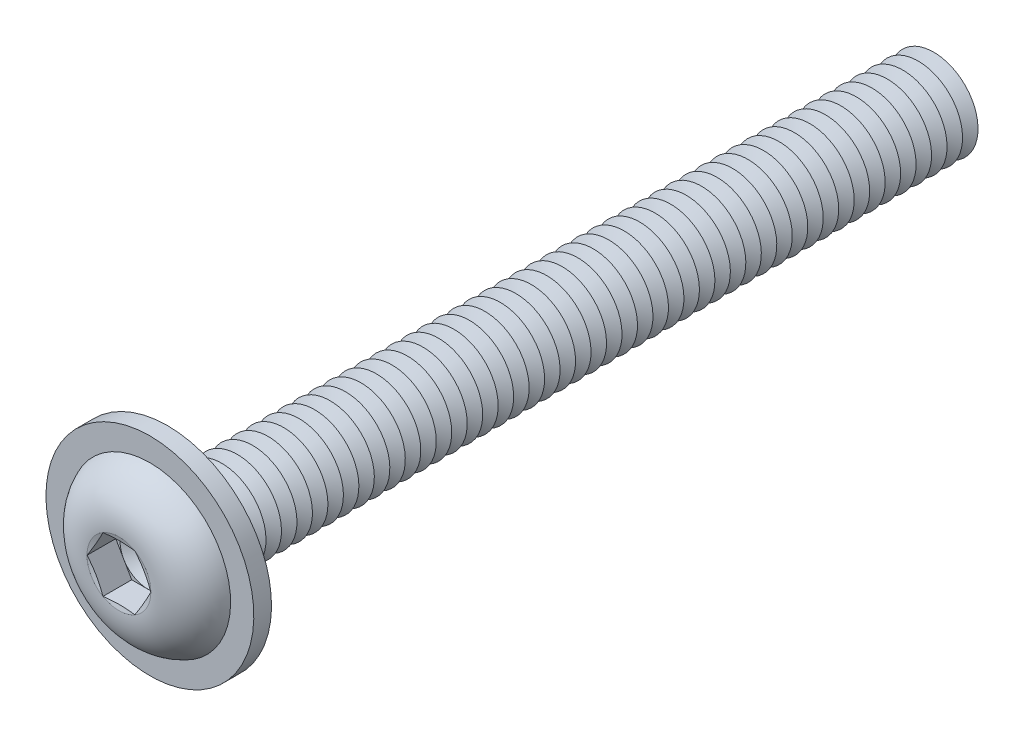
ISO-10303-21;
HEADER;
FILE_DESCRIPTION(('STEP AP214'),'2;1');
FILE_NAME('part.step','',(''),(''),'','','');
FILE_SCHEMA(('AUTOMOTIVE_DESIGN { 1 0 10303 214 1 1 1 1 }'));
ENDSEC;
DATA;
#1=APPLICATION_CONTEXT('core data for automotive mechanical design processes');
#2=APPLICATION_PROTOCOL_DEFINITION('international standard','automotive_design',2000,#1);
#3=PRODUCT_CONTEXT('',#1,'mechanical');
#4=PRODUCT('Part','Part','',(#3));
#5=PRODUCT_RELATED_PRODUCT_CATEGORY('part','',(#4));
#6=PRODUCT_DEFINITION_FORMATION('','',#4);
#7=PRODUCT_DEFINITION_CONTEXT('part definition',#1,'design');
#8=PRODUCT_DEFINITION('design','',#6,#7);
#9=PRODUCT_DEFINITION_SHAPE('','',#8);
#10=(LENGTH_UNIT() NAMED_UNIT(*) SI_UNIT(.MILLI.,.METRE.));
#11=(NAMED_UNIT(*) PLANE_ANGLE_UNIT() SI_UNIT($,.RADIAN.));
#12=(NAMED_UNIT(*) SI_UNIT($,.STERADIAN.) SOLID_ANGLE_UNIT());
#13=UNCERTAINTY_MEASURE_WITH_UNIT(LENGTH_MEASURE(1.E-05),#10,'distance_accuracy_value','');
#14=(GEOMETRIC_REPRESENTATION_CONTEXT(3) GLOBAL_UNCERTAINTY_ASSIGNED_CONTEXT((#13)) GLOBAL_UNIT_ASSIGNED_CONTEXT((#10,
#11,#12)) REPRESENTATION_CONTEXT('',''));
#15=CARTESIAN_POINT('',(0.,0.,0.));
#16=DIRECTION('',(0.,0.,1.));
#17=DIRECTION('',(1.,0.,0.));
#18=AXIS2_PLACEMENT_3D('',#15,#16,#17);
#19=CARTESIAN_POINT('',(0.,0.,-32.55));
#20=DIRECTION('',(0.,0.,1.));
#21=DIRECTION('',(0.,-1.,0.));
#22=AXIS2_PLACEMENT_3D('',#19,#20,#21);
#23=CONICAL_SURFACE('',#22,1.99999999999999,1.04719755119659);
#24=CARTESIAN_POINT('',(0.,0.,-32.9));
#25=DIRECTION('',(0.,0.,1.));
#26=DIRECTION('',(0.,-1.,0.));
#27=AXIS2_PLACEMENT_3D('',#24,#25,#26);
#28=CIRCLE('',#27,1.39378221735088);
#29=CARTESIAN_POINT('',(0.,-1.39378221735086,-32.9));
#30=VERTEX_POINT('',#29);
#31=EDGE_CURVE('E608',#30,#30,#28,.T.);
#32=ORIENTED_EDGE('',*,*,#31,.T.);
#33=EDGE_LOOP('',(#32));
#34=FACE_BOUND('',#33,.T.);
#35=CARTESIAN_POINT('',(0.,0.,-32.55));
#36=DIRECTION('',(0.,0.,1.));
#37=DIRECTION('',(0.,-1.,0.));
#38=AXIS2_PLACEMENT_3D('',#35,#36,#37);
#39=CIRCLE('',#38,1.99999999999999);
#40=CARTESIAN_POINT('',(0.,-1.99999999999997,-32.55));
#41=VERTEX_POINT('',#40);
#42=EDGE_CURVE('E604',#41,#41,#39,.T.);
#43=ORIENTED_EDGE('',*,*,#42,.F.);
#44=EDGE_LOOP('',(#43));
#45=FACE_BOUND('',#44,.T.);
#46=ADVANCED_FACE('F39',(#34,#45),#23,.T.);
#47=CARTESIAN_POINT('',(0.,0.,-32.9));
#48=DIRECTION('',(0.,0.,-1.));
#49=DIRECTION('',(0.,1.,0.));
#50=AXIS2_PLACEMENT_3D('',#47,#48,#49);
#51=CONICAL_SURFACE('',#50,1.39378221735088,1.04719755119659);
#52=CARTESIAN_POINT('',(0.,0.,-33.25));
#53=DIRECTION('',(0.,0.,1.));
#54=DIRECTION('',(0.,-1.,0.));
#55=AXIS2_PLACEMENT_3D('',#52,#53,#54);
#56=CIRCLE('',#55,1.99999999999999);
#57=CARTESIAN_POINT('',(0.,-1.99999999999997,-33.25));
#58=VERTEX_POINT('',#57);
#59=EDGE_CURVE('E612',#58,#58,#56,.T.);
#60=ORIENTED_EDGE('',*,*,#59,.T.);
#61=EDGE_LOOP('',(#60));
#62=FACE_BOUND('',#61,.T.);
#63=ORIENTED_EDGE('',*,*,#31,.F.);
#64=EDGE_LOOP('',(#63));
#65=FACE_BOUND('',#64,.T.);
#66=ADVANCED_FACE('F730',(#62,#65),#51,.T.);
#67=CARTESIAN_POINT('',(0.,2.,-35.));
#68=DIRECTION('',(0.,0.,-1.));
#69=DIRECTION('',(0.,1.,0.));
#70=AXIS2_PLACEMENT_3D('',#67,#68,#69);
#71=PLANE('',#70);
#72=CARTESIAN_POINT('',(0.,0.,-35.));
#73=DIRECTION('',(0.,0.,1.));
#74=DIRECTION('',(0.,-1.,0.));
#75=AXIS2_PLACEMENT_3D('',#72,#73,#74);
#76=CIRCLE('',#75,1.39378221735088);
#77=CARTESIAN_POINT('',(0.,-1.39378221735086,-35.));
#78=VERTEX_POINT('',#77);
#79=EDGE_CURVE('E632',#78,#78,#76,.T.);
#80=ORIENTED_EDGE('',*,*,#79,.F.);
#81=EDGE_LOOP('',(#80));
#82=FACE_BOUND('',#81,.T.);
#83=ADVANCED_FACE('F736',(#82),#71,.T.);
#84=CARTESIAN_POINT('',(0.,0.,-34.65));
#85=DIRECTION('',(0.,0.,1.));
#86=DIRECTION('',(0.,-1.,0.));
#87=AXIS2_PLACEMENT_3D('',#84,#85,#86);
#88=CONICAL_SURFACE('',#87,1.99999999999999,1.04719755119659);
#89=ORIENTED_EDGE('',*,*,#79,.T.);
#90=EDGE_LOOP('',(#89));
#91=FACE_BOUND('',#90,.T.);
#92=CARTESIAN_POINT('',(0.,0.,-34.65));
#93=DIRECTION('',(0.,0.,1.));
#94=DIRECTION('',(0.,-1.,0.));
#95=AXIS2_PLACEMENT_3D('',#92,#93,#94);
#96=CIRCLE('',#95,1.99999999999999);
#97=CARTESIAN_POINT('',(0.,-1.99999999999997,-34.65));
#98=VERTEX_POINT('',#97);
#99=EDGE_CURVE('E628',#98,#98,#96,.T.);
#100=ORIENTED_EDGE('',*,*,#99,.F.);
#101=EDGE_LOOP('',(#100));
#102=FACE_BOUND('',#101,.T.);
#103=ADVANCED_FACE('F755',(#91,#102),#88,.T.);
#104=CARTESIAN_POINT('',(0.,0.,-34.3));
#105=DIRECTION('',(0.,0.,-1.));
#106=DIRECTION('',(0.,1.,0.));
#107=AXIS2_PLACEMENT_3D('',#104,#105,#106);
#108=CONICAL_SURFACE('',#107,1.39378221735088,1.04719755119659);
#109=ORIENTED_EDGE('',*,*,#99,.T.);
#110=EDGE_LOOP('',(#109));
#111=FACE_BOUND('',#110,.T.);
#112=CARTESIAN_POINT('',(0.,0.,-34.3));
#113=DIRECTION('',(0.,0.,1.));
#114=DIRECTION('',(0.,-1.,0.));
#115=AXIS2_PLACEMENT_3D('',#112,#113,#114);
#116=CIRCLE('',#115,1.39378221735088);
#117=CARTESIAN_POINT('',(0.,-1.39378221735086,-34.3));
#118=VERTEX_POINT('',#117);
#119=EDGE_CURVE('E624',#118,#118,#116,.T.);
#120=ORIENTED_EDGE('',*,*,#119,.F.);
#121=EDGE_LOOP('',(#120));
#122=FACE_BOUND('',#121,.T.);
#123=ADVANCED_FACE('F752',(#111,#122),#108,.T.);
#124=CARTESIAN_POINT('',(0.,0.,-33.95));
#125=DIRECTION('',(0.,0.,1.));
#126=DIRECTION('',(0.,-1.,0.));
#127=AXIS2_PLACEMENT_3D('',#124,#125,#126);
#128=CONICAL_SURFACE('',#127,1.99999999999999,1.04719755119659);
#129=ORIENTED_EDGE('',*,*,#119,.T.);
#130=EDGE_LOOP('',(#129));
#131=FACE_BOUND('',#130,.T.);
#132=CARTESIAN_POINT('',(0.,0.,-33.95));
#133=DIRECTION('',(0.,0.,1.));
#134=DIRECTION('',(0.,-1.,0.));
#135=AXIS2_PLACEMENT_3D('',#132,#133,#134);
#136=CIRCLE('',#135,1.99999999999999);
#137=CARTESIAN_POINT('',(0.,-1.99999999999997,-33.95));
#138=VERTEX_POINT('',#137);
#139=EDGE_CURVE('E620',#138,#138,#136,.T.);
#140=ORIENTED_EDGE('',*,*,#139,.F.);
#141=EDGE_LOOP('',(#140));
#142=FACE_BOUND('',#141,.T.);
#143=ADVANCED_FACE('F746',(#131,#142),#128,.T.);
#144=CARTESIAN_POINT('',(0.,0.,-33.6));
#145=DIRECTION('',(0.,0.,-1.));
#146=DIRECTION('',(0.,1.,0.));
#147=AXIS2_PLACEMENT_3D('',#144,#145,#146);
#148=CONICAL_SURFACE('',#147,1.39378221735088,1.04719755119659);
#149=ORIENTED_EDGE('',*,*,#139,.T.);
#150=EDGE_LOOP('',(#149));
#151=FACE_BOUND('',#150,.T.);
#152=CARTESIAN_POINT('',(0.,0.,-33.6));
#153=DIRECTION('',(0.,0.,1.));
#154=DIRECTION('',(0.,-1.,0.));
#155=AXIS2_PLACEMENT_3D('',#152,#153,#154);
#156=CIRCLE('',#155,1.39378221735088);
#157=CARTESIAN_POINT('',(0.,-1.39378221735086,-33.6));
#158=VERTEX_POINT('',#157);
#159=EDGE_CURVE('E616',#158,#158,#156,.T.);
#160=ORIENTED_EDGE('',*,*,#159,.F.);
#161=EDGE_LOOP('',(#160));
#162=FACE_BOUND('',#161,.T.);
#163=ADVANCED_FACE('F742',(#151,#162),#148,.T.);
#164=CARTESIAN_POINT('',(0.,0.,-33.25));
#165=DIRECTION('',(0.,0.,1.));
#166=DIRECTION('',(0.,-1.,0.));
#167=AXIS2_PLACEMENT_3D('',#164,#165,#166);
#168=CONICAL_SURFACE('',#167,1.99999999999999,1.04719755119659);
#169=ORIENTED_EDGE('',*,*,#159,.T.);
#170=EDGE_LOOP('',(#169));
#171=FACE_BOUND('',#170,.T.);
#172=ORIENTED_EDGE('',*,*,#59,.F.);
#173=EDGE_LOOP('',(#172));
#174=FACE_BOUND('',#173,.T.);
#175=ADVANCED_FACE('F745',(#171,#174),#168,.T.);
#176=CARTESIAN_POINT('',(0.,0.,-31.85));
#177=DIRECTION('',(0.,0.,1.));
#178=DIRECTION('',(0.,-1.,0.));
#179=AXIS2_PLACEMENT_3D('',#176,#177,#178);
#180=CONICAL_SURFACE('',#179,1.99999999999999,1.04719755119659);
#181=CARTESIAN_POINT('',(0.,0.,-32.2));
#182=DIRECTION('',(0.,0.,1.));
#183=DIRECTION('',(0.,-1.,0.));
#184=AXIS2_PLACEMENT_3D('',#181,#182,#183);
#185=CIRCLE('',#184,1.39378221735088);
#186=CARTESIAN_POINT('',(0.,-1.39378221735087,-32.2));
#187=VERTEX_POINT('',#186);
#188=EDGE_CURVE('E600',#187,#187,#185,.T.);
#189=ORIENTED_EDGE('',*,*,#188,.T.);
#190=EDGE_LOOP('',(#189));
#191=FACE_BOUND('',#190,.T.);
#192=CARTESIAN_POINT('',(0.,0.,-31.85));
#193=DIRECTION('',(0.,0.,1.));
#194=DIRECTION('',(0.,-1.,0.));
#195=AXIS2_PLACEMENT_3D('',#192,#193,#194);
#196=CIRCLE('',#195,1.99999999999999);
#197=CARTESIAN_POINT('',(0.,-1.99999999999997,-31.85));
#198=VERTEX_POINT('',#197);
#199=EDGE_CURVE('E596',#198,#198,#196,.T.);
#200=ORIENTED_EDGE('',*,*,#199,.F.);
#201=EDGE_LOOP('',(#200));
#202=FACE_BOUND('',#201,.T.);
#203=ADVANCED_FACE('F750',(#191,#202),#180,.T.);
#204=CARTESIAN_POINT('',(0.,0.,-32.2));
#205=DIRECTION('',(0.,0.,-1.));
#206=DIRECTION('',(0.,1.,0.));
#207=AXIS2_PLACEMENT_3D('',#204,#205,#206);
#208=CONICAL_SURFACE('',#207,1.39378221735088,1.04719755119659);
#209=ORIENTED_EDGE('',*,*,#42,.T.);
#210=EDGE_LOOP('',(#209));
#211=FACE_BOUND('',#210,.T.);
#212=ORIENTED_EDGE('',*,*,#188,.F.);
#213=EDGE_LOOP('',(#212));
#214=FACE_BOUND('',#213,.T.);
#215=ADVANCED_FACE('F801',(#211,#214),#208,.T.);
#216=CARTESIAN_POINT('',(0.,0.,-31.15));
#217=DIRECTION('',(0.,0.,1.));
#218=DIRECTION('',(0.,-1.,0.));
#219=AXIS2_PLACEMENT_3D('',#216,#217,#218);
#220=CONICAL_SURFACE('',#219,1.99999999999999,1.04719755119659);
#221=CARTESIAN_POINT('',(0.,0.,-31.5));
#222=DIRECTION('',(0.,0.,1.));
#223=DIRECTION('',(0.,-1.,0.));
#224=AXIS2_PLACEMENT_3D('',#221,#222,#223);
#225=CIRCLE('',#224,1.39378221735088);
#226=CARTESIAN_POINT('',(0.,-1.39378221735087,-31.5));
#227=VERTEX_POINT('',#226);
#228=EDGE_CURVE('E592',#227,#227,#225,.T.);
#229=ORIENTED_EDGE('',*,*,#228,.T.);
#230=EDGE_LOOP('',(#229));
#231=FACE_BOUND('',#230,.T.);
#232=CARTESIAN_POINT('',(0.,0.,-31.15));
#233=DIRECTION('',(0.,0.,1.));
#234=DIRECTION('',(0.,-1.,0.));
#235=AXIS2_PLACEMENT_3D('',#232,#233,#234);
#236=CIRCLE('',#235,1.99999999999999);
#237=CARTESIAN_POINT('',(0.,-1.99999999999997,-31.15));
#238=VERTEX_POINT('',#237);
#239=EDGE_CURVE('E588',#238,#238,#236,.T.);
#240=ORIENTED_EDGE('',*,*,#239,.F.);
#241=EDGE_LOOP('',(#240));
#242=FACE_BOUND('',#241,.T.);
#243=ADVANCED_FACE('F807',(#231,#242),#220,.T.);
#244=CARTESIAN_POINT('',(0.,0.,-31.5));
#245=DIRECTION('',(0.,0.,-1.));
#246=DIRECTION('',(0.,1.,0.));
#247=AXIS2_PLACEMENT_3D('',#244,#245,#246);
#248=CONICAL_SURFACE('',#247,1.39378221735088,1.04719755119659);
#249=ORIENTED_EDGE('',*,*,#199,.T.);
#250=EDGE_LOOP('',(#249));
#251=FACE_BOUND('',#250,.T.);
#252=ORIENTED_EDGE('',*,*,#228,.F.);
#253=EDGE_LOOP('',(#252));
#254=FACE_BOUND('',#253,.T.);
#255=ADVANCED_FACE('F814',(#251,#254),#248,.T.);
#256=CARTESIAN_POINT('',(0.,0.,-30.45));
#257=DIRECTION('',(0.,0.,1.));
#258=DIRECTION('',(0.,-1.,0.));
#259=AXIS2_PLACEMENT_3D('',#256,#257,#258);
#260=CONICAL_SURFACE('',#259,1.99999999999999,1.04719755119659);
#261=CARTESIAN_POINT('',(0.,0.,-30.8));
#262=DIRECTION('',(0.,0.,1.));
#263=DIRECTION('',(0.,-1.,0.));
#264=AXIS2_PLACEMENT_3D('',#261,#262,#263);
#265=CIRCLE('',#264,1.39378221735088);
#266=CARTESIAN_POINT('',(0.,-1.39378221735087,-30.8));
#267=VERTEX_POINT('',#266);
#268=EDGE_CURVE('E584',#267,#267,#265,.T.);
#269=ORIENTED_EDGE('',*,*,#268,.T.);
#270=EDGE_LOOP('',(#269));
#271=FACE_BOUND('',#270,.T.);
#272=CARTESIAN_POINT('',(0.,0.,-30.45));
#273=DIRECTION('',(0.,0.,1.));
#274=DIRECTION('',(0.,-1.,0.));
#275=AXIS2_PLACEMENT_3D('',#272,#273,#274);
#276=CIRCLE('',#275,1.99999999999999);
#277=CARTESIAN_POINT('',(0.,-1.99999999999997,-30.45));
#278=VERTEX_POINT('',#277);
#279=EDGE_CURVE('E580',#278,#278,#276,.T.);
#280=ORIENTED_EDGE('',*,*,#279,.F.);
#281=EDGE_LOOP('',(#280));
#282=FACE_BOUND('',#281,.T.);
#283=ADVANCED_FACE('F821',(#271,#282),#260,.T.);
#284=CARTESIAN_POINT('',(0.,0.,-30.8));
#285=DIRECTION('',(0.,0.,-1.));
#286=DIRECTION('',(0.,1.,0.));
#287=AXIS2_PLACEMENT_3D('',#284,#285,#286);
#288=CONICAL_SURFACE('',#287,1.39378221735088,1.04719755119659);
#289=ORIENTED_EDGE('',*,*,#239,.T.);
#290=EDGE_LOOP('',(#289));
#291=FACE_BOUND('',#290,.T.);
#292=ORIENTED_EDGE('',*,*,#268,.F.);
#293=EDGE_LOOP('',(#292));
#294=FACE_BOUND('',#293,.T.);
#295=ADVANCED_FACE('F828',(#291,#294),#288,.T.);
#296=CARTESIAN_POINT('',(0.,0.,-29.75));
#297=DIRECTION('',(0.,0.,1.));
#298=DIRECTION('',(0.,-1.,0.));
#299=AXIS2_PLACEMENT_3D('',#296,#297,#298);
#300=CONICAL_SURFACE('',#299,1.99999999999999,1.04719755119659);
#301=CARTESIAN_POINT('',(0.,0.,-30.1));
#302=DIRECTION('',(0.,0.,1.));
#303=DIRECTION('',(0.,-1.,0.));
#304=AXIS2_PLACEMENT_3D('',#301,#302,#303);
#305=CIRCLE('',#304,1.39378221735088);
#306=CARTESIAN_POINT('',(0.,-1.39378221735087,-30.1));
#307=VERTEX_POINT('',#306);
#308=EDGE_CURVE('E576',#307,#307,#305,.T.);
#309=ORIENTED_EDGE('',*,*,#308,.T.);
#310=EDGE_LOOP('',(#309));
#311=FACE_BOUND('',#310,.T.);
#312=CARTESIAN_POINT('',(0.,0.,-29.75));
#313=DIRECTION('',(0.,0.,1.));
#314=DIRECTION('',(0.,-1.,0.));
#315=AXIS2_PLACEMENT_3D('',#312,#313,#314);
#316=CIRCLE('',#315,1.99999999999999);
#317=CARTESIAN_POINT('',(0.,-1.99999999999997,-29.75));
#318=VERTEX_POINT('',#317);
#319=EDGE_CURVE('E572',#318,#318,#316,.T.);
#320=ORIENTED_EDGE('',*,*,#319,.F.);
#321=EDGE_LOOP('',(#320));
#322=FACE_BOUND('',#321,.T.);
#323=ADVANCED_FACE('F835',(#311,#322),#300,.T.);
#324=CARTESIAN_POINT('',(0.,0.,-30.1));
#325=DIRECTION('',(0.,0.,-1.));
#326=DIRECTION('',(0.,1.,0.));
#327=AXIS2_PLACEMENT_3D('',#324,#325,#326);
#328=CONICAL_SURFACE('',#327,1.39378221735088,1.04719755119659);
#329=ORIENTED_EDGE('',*,*,#279,.T.);
#330=EDGE_LOOP('',(#329));
#331=FACE_BOUND('',#330,.T.);
#332=ORIENTED_EDGE('',*,*,#308,.F.);
#333=EDGE_LOOP('',(#332));
#334=FACE_BOUND('',#333,.T.);
#335=ADVANCED_FACE('F842',(#331,#334),#328,.T.);
#336=CARTESIAN_POINT('',(0.,0.,-29.05));
#337=DIRECTION('',(0.,0.,1.));
#338=DIRECTION('',(0.,-1.,0.));
#339=AXIS2_PLACEMENT_3D('',#336,#337,#338);
#340=CONICAL_SURFACE('',#339,1.99999999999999,1.04719755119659);
#341=CARTESIAN_POINT('',(0.,0.,-29.4));
#342=DIRECTION('',(0.,0.,1.));
#343=DIRECTION('',(0.,-1.,0.));
#344=AXIS2_PLACEMENT_3D('',#341,#342,#343);
#345=CIRCLE('',#344,1.39378221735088);
#346=CARTESIAN_POINT('',(0.,-1.39378221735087,-29.4));
#347=VERTEX_POINT('',#346);
#348=EDGE_CURVE('E568',#347,#347,#345,.T.);
#349=ORIENTED_EDGE('',*,*,#348,.T.);
#350=EDGE_LOOP('',(#349));
#351=FACE_BOUND('',#350,.T.);
#352=CARTESIAN_POINT('',(0.,0.,-29.05));
#353=DIRECTION('',(0.,0.,1.));
#354=DIRECTION('',(0.,-1.,0.));
#355=AXIS2_PLACEMENT_3D('',#352,#353,#354);
#356=CIRCLE('',#355,1.99999999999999);
#357=CARTESIAN_POINT('',(0.,-1.99999999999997,-29.05));
#358=VERTEX_POINT('',#357);
#359=EDGE_CURVE('E564',#358,#358,#356,.T.);
#360=ORIENTED_EDGE('',*,*,#359,.F.);
#361=EDGE_LOOP('',(#360));
#362=FACE_BOUND('',#361,.T.);
#363=ADVANCED_FACE('F849',(#351,#362),#340,.T.);
#364=CARTESIAN_POINT('',(0.,0.,-29.4));
#365=DIRECTION('',(0.,0.,-1.));
#366=DIRECTION('',(0.,1.,0.));
#367=AXIS2_PLACEMENT_3D('',#364,#365,#366);
#368=CONICAL_SURFACE('',#367,1.39378221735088,1.04719755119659);
#369=ORIENTED_EDGE('',*,*,#319,.T.);
#370=EDGE_LOOP('',(#369));
#371=FACE_BOUND('',#370,.T.);
#372=ORIENTED_EDGE('',*,*,#348,.F.);
#373=EDGE_LOOP('',(#372));
#374=FACE_BOUND('',#373,.T.);
#375=ADVANCED_FACE('F856',(#371,#374),#368,.T.);
#376=CARTESIAN_POINT('',(0.,0.,-28.35));
#377=DIRECTION('',(0.,0.,1.));
#378=DIRECTION('',(0.,-1.,0.));
#379=AXIS2_PLACEMENT_3D('',#376,#377,#378);
#380=CONICAL_SURFACE('',#379,1.99999999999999,1.04719755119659);
#381=CARTESIAN_POINT('',(0.,0.,-28.7));
#382=DIRECTION('',(0.,0.,1.));
#383=DIRECTION('',(0.,-1.,0.));
#384=AXIS2_PLACEMENT_3D('',#381,#382,#383);
#385=CIRCLE('',#384,1.39378221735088);
#386=CARTESIAN_POINT('',(0.,-1.39378221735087,-28.7));
#387=VERTEX_POINT('',#386);
#388=EDGE_CURVE('E560',#387,#387,#385,.T.);
#389=ORIENTED_EDGE('',*,*,#388,.T.);
#390=EDGE_LOOP('',(#389));
#391=FACE_BOUND('',#390,.T.);
#392=CARTESIAN_POINT('',(0.,0.,-28.35));
#393=DIRECTION('',(0.,0.,1.));
#394=DIRECTION('',(0.,-1.,0.));
#395=AXIS2_PLACEMENT_3D('',#392,#393,#394);
#396=CIRCLE('',#395,1.99999999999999);
#397=CARTESIAN_POINT('',(0.,-1.99999999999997,-28.35));
#398=VERTEX_POINT('',#397);
#399=EDGE_CURVE('E556',#398,#398,#396,.T.);
#400=ORIENTED_EDGE('',*,*,#399,.F.);
#401=EDGE_LOOP('',(#400));
#402=FACE_BOUND('',#401,.T.);
#403=ADVANCED_FACE('F863',(#391,#402),#380,.T.);
#404=CARTESIAN_POINT('',(0.,0.,-28.7));
#405=DIRECTION('',(0.,0.,-1.));
#406=DIRECTION('',(0.,1.,0.));
#407=AXIS2_PLACEMENT_3D('',#404,#405,#406);
#408=CONICAL_SURFACE('',#407,1.39378221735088,1.04719755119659);
#409=ORIENTED_EDGE('',*,*,#359,.T.);
#410=EDGE_LOOP('',(#409));
#411=FACE_BOUND('',#410,.T.);
#412=ORIENTED_EDGE('',*,*,#388,.F.);
#413=EDGE_LOOP('',(#412));
#414=FACE_BOUND('',#413,.T.);
#415=ADVANCED_FACE('F870',(#411,#414),#408,.T.);
#416=CARTESIAN_POINT('',(0.,0.,-27.65));
#417=DIRECTION('',(0.,0.,1.));
#418=DIRECTION('',(0.,-1.,0.));
#419=AXIS2_PLACEMENT_3D('',#416,#417,#418);
#420=CONICAL_SURFACE('',#419,1.99999999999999,1.04719755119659);
#421=CARTESIAN_POINT('',(0.,0.,-28.));
#422=DIRECTION('',(0.,0.,1.));
#423=DIRECTION('',(0.,-1.,0.));
#424=AXIS2_PLACEMENT_3D('',#421,#422,#423);
#425=CIRCLE('',#424,1.39378221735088);
#426=CARTESIAN_POINT('',(0.,-1.39378221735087,-28.));
#427=VERTEX_POINT('',#426);
#428=EDGE_CURVE('E552',#427,#427,#425,.T.);
#429=ORIENTED_EDGE('',*,*,#428,.T.);
#430=EDGE_LOOP('',(#429));
#431=FACE_BOUND('',#430,.T.);
#432=CARTESIAN_POINT('',(0.,0.,-27.65));
#433=DIRECTION('',(0.,0.,1.));
#434=DIRECTION('',(0.,-1.,0.));
#435=AXIS2_PLACEMENT_3D('',#432,#433,#434);
#436=CIRCLE('',#435,1.99999999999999);
#437=CARTESIAN_POINT('',(0.,-1.99999999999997,-27.65));
#438=VERTEX_POINT('',#437);
#439=EDGE_CURVE('E548',#438,#438,#436,.T.);
#440=ORIENTED_EDGE('',*,*,#439,.F.);
#441=EDGE_LOOP('',(#440));
#442=FACE_BOUND('',#441,.T.);
#443=ADVANCED_FACE('F877',(#431,#442),#420,.T.);
#444=CARTESIAN_POINT('',(0.,0.,-28.));
#445=DIRECTION('',(0.,0.,-1.));
#446=DIRECTION('',(0.,1.,0.));
#447=AXIS2_PLACEMENT_3D('',#444,#445,#446);
#448=CONICAL_SURFACE('',#447,1.39378221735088,1.04719755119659);
#449=ORIENTED_EDGE('',*,*,#399,.T.);
#450=EDGE_LOOP('',(#449));
#451=FACE_BOUND('',#450,.T.);
#452=ORIENTED_EDGE('',*,*,#428,.F.);
#453=EDGE_LOOP('',(#452));
#454=FACE_BOUND('',#453,.T.);
#455=ADVANCED_FACE('F884',(#451,#454),#448,.T.);
#456=CARTESIAN_POINT('',(0.,0.,-26.95));
#457=DIRECTION('',(0.,0.,1.));
#458=DIRECTION('',(0.,-1.,0.));
#459=AXIS2_PLACEMENT_3D('',#456,#457,#458);
#460=CONICAL_SURFACE('',#459,1.99999999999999,1.04719755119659);
#461=CARTESIAN_POINT('',(0.,0.,-27.3));
#462=DIRECTION('',(0.,0.,1.));
#463=DIRECTION('',(0.,-1.,0.));
#464=AXIS2_PLACEMENT_3D('',#461,#462,#463);
#465=CIRCLE('',#464,1.39378221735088);
#466=CARTESIAN_POINT('',(0.,-1.39378221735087,-27.3));
#467=VERTEX_POINT('',#466);
#468=EDGE_CURVE('E544',#467,#467,#465,.T.);
#469=ORIENTED_EDGE('',*,*,#468,.T.);
#470=EDGE_LOOP('',(#469));
#471=FACE_BOUND('',#470,.T.);
#472=CARTESIAN_POINT('',(0.,0.,-26.95));
#473=DIRECTION('',(0.,0.,1.));
#474=DIRECTION('',(0.,-1.,0.));
#475=AXIS2_PLACEMENT_3D('',#472,#473,#474);
#476=CIRCLE('',#475,1.99999999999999);
#477=CARTESIAN_POINT('',(0.,-1.99999999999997,-26.95));
#478=VERTEX_POINT('',#477);
#479=EDGE_CURVE('E540',#478,#478,#476,.T.);
#480=ORIENTED_EDGE('',*,*,#479,.F.);
#481=EDGE_LOOP('',(#480));
#482=FACE_BOUND('',#481,.T.);
#483=ADVANCED_FACE('F891',(#471,#482),#460,.T.);
#484=CARTESIAN_POINT('',(0.,0.,-27.3));
#485=DIRECTION('',(0.,0.,-1.));
#486=DIRECTION('',(0.,1.,0.));
#487=AXIS2_PLACEMENT_3D('',#484,#485,#486);
#488=CONICAL_SURFACE('',#487,1.39378221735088,1.04719755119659);
#489=ORIENTED_EDGE('',*,*,#439,.T.);
#490=EDGE_LOOP('',(#489));
#491=FACE_BOUND('',#490,.T.);
#492=ORIENTED_EDGE('',*,*,#468,.F.);
#493=EDGE_LOOP('',(#492));
#494=FACE_BOUND('',#493,.T.);
#495=ADVANCED_FACE('F898',(#491,#494),#488,.T.);
#496=CARTESIAN_POINT('',(0.,0.,-26.25));
#497=DIRECTION('',(0.,0.,1.));
#498=DIRECTION('',(0.,-1.,0.));
#499=AXIS2_PLACEMENT_3D('',#496,#497,#498);
#500=CONICAL_SURFACE('',#499,1.99999999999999,1.04719755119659);
#501=CARTESIAN_POINT('',(0.,0.,-26.6));
#502=DIRECTION('',(0.,0.,1.));
#503=DIRECTION('',(0.,-1.,0.));
#504=AXIS2_PLACEMENT_3D('',#501,#502,#503);
#505=CIRCLE('',#504,1.39378221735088);
#506=CARTESIAN_POINT('',(0.,-1.39378221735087,-26.6));
#507=VERTEX_POINT('',#506);
#508=EDGE_CURVE('E536',#507,#507,#505,.T.);
#509=ORIENTED_EDGE('',*,*,#508,.T.);
#510=EDGE_LOOP('',(#509));
#511=FACE_BOUND('',#510,.T.);
#512=CARTESIAN_POINT('',(0.,0.,-26.25));
#513=DIRECTION('',(0.,0.,1.));
#514=DIRECTION('',(0.,-1.,0.));
#515=AXIS2_PLACEMENT_3D('',#512,#513,#514);
#516=CIRCLE('',#515,1.99999999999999);
#517=CARTESIAN_POINT('',(0.,-1.99999999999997,-26.25));
#518=VERTEX_POINT('',#517);
#519=EDGE_CURVE('E532',#518,#518,#516,.T.);
#520=ORIENTED_EDGE('',*,*,#519,.F.);
#521=EDGE_LOOP('',(#520));
#522=FACE_BOUND('',#521,.T.);
#523=ADVANCED_FACE('F905',(#511,#522),#500,.T.);
#524=CARTESIAN_POINT('',(0.,0.,-26.6));
#525=DIRECTION('',(0.,0.,-1.));
#526=DIRECTION('',(0.,1.,0.));
#527=AXIS2_PLACEMENT_3D('',#524,#525,#526);
#528=CONICAL_SURFACE('',#527,1.39378221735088,1.04719755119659);
#529=ORIENTED_EDGE('',*,*,#479,.T.);
#530=EDGE_LOOP('',(#529));
#531=FACE_BOUND('',#530,.T.);
#532=ORIENTED_EDGE('',*,*,#508,.F.);
#533=EDGE_LOOP('',(#532));
#534=FACE_BOUND('',#533,.T.);
#535=ADVANCED_FACE('F912',(#531,#534),#528,.T.);
#536=CARTESIAN_POINT('',(0.,0.,-25.55));
#537=DIRECTION('',(0.,0.,1.));
#538=DIRECTION('',(0.,-1.,0.));
#539=AXIS2_PLACEMENT_3D('',#536,#537,#538);
#540=CONICAL_SURFACE('',#539,1.99999999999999,1.04719755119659);
#541=CARTESIAN_POINT('',(0.,0.,-25.9));
#542=DIRECTION('',(0.,0.,1.));
#543=DIRECTION('',(0.,-1.,0.));
#544=AXIS2_PLACEMENT_3D('',#541,#542,#543);
#545=CIRCLE('',#544,1.39378221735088);
#546=CARTESIAN_POINT('',(0.,-1.39378221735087,-25.9));
#547=VERTEX_POINT('',#546);
#548=EDGE_CURVE('E528',#547,#547,#545,.T.);
#549=ORIENTED_EDGE('',*,*,#548,.T.);
#550=EDGE_LOOP('',(#549));
#551=FACE_BOUND('',#550,.T.);
#552=CARTESIAN_POINT('',(0.,0.,-25.55));
#553=DIRECTION('',(0.,0.,1.));
#554=DIRECTION('',(0.,-1.,0.));
#555=AXIS2_PLACEMENT_3D('',#552,#553,#554);
#556=CIRCLE('',#555,1.99999999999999);
#557=CARTESIAN_POINT('',(0.,-1.99999999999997,-25.55));
#558=VERTEX_POINT('',#557);
#559=EDGE_CURVE('E524',#558,#558,#556,.T.);
#560=ORIENTED_EDGE('',*,*,#559,.F.);
#561=EDGE_LOOP('',(#560));
#562=FACE_BOUND('',#561,.T.);
#563=ADVANCED_FACE('F919',(#551,#562),#540,.T.);
#564=CARTESIAN_POINT('',(0.,0.,-25.9));
#565=DIRECTION('',(0.,0.,-1.));
#566=DIRECTION('',(0.,1.,0.));
#567=AXIS2_PLACEMENT_3D('',#564,#565,#566);
#568=CONICAL_SURFACE('',#567,1.39378221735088,1.04719755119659);
#569=ORIENTED_EDGE('',*,*,#519,.T.);
#570=EDGE_LOOP('',(#569));
#571=FACE_BOUND('',#570,.T.);
#572=ORIENTED_EDGE('',*,*,#548,.F.);
#573=EDGE_LOOP('',(#572));
#574=FACE_BOUND('',#573,.T.);
#575=ADVANCED_FACE('F926',(#571,#574),#568,.T.);
#576=CARTESIAN_POINT('',(0.,0.,-24.85));
#577=DIRECTION('',(0.,0.,1.));
#578=DIRECTION('',(0.,-1.,0.));
#579=AXIS2_PLACEMENT_3D('',#576,#577,#578);
#580=CONICAL_SURFACE('',#579,1.99999999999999,1.04719755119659);
#581=CARTESIAN_POINT('',(0.,0.,-25.2));
#582=DIRECTION('',(0.,0.,1.));
#583=DIRECTION('',(0.,-1.,0.));
#584=AXIS2_PLACEMENT_3D('',#581,#582,#583);
#585=CIRCLE('',#584,1.39378221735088);
#586=CARTESIAN_POINT('',(0.,-1.39378221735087,-25.2));
#587=VERTEX_POINT('',#586);
#588=EDGE_CURVE('E520',#587,#587,#585,.T.);
#589=ORIENTED_EDGE('',*,*,#588,.T.);
#590=EDGE_LOOP('',(#589));
#591=FACE_BOUND('',#590,.T.);
#592=CARTESIAN_POINT('',(0.,0.,-24.85));
#593=DIRECTION('',(0.,0.,1.));
#594=DIRECTION('',(0.,-1.,0.));
#595=AXIS2_PLACEMENT_3D('',#592,#593,#594);
#596=CIRCLE('',#595,1.99999999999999);
#597=CARTESIAN_POINT('',(0.,-1.99999999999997,-24.85));
#598=VERTEX_POINT('',#597);
#599=EDGE_CURVE('E516',#598,#598,#596,.T.);
#600=ORIENTED_EDGE('',*,*,#599,.F.);
#601=EDGE_LOOP('',(#600));
#602=FACE_BOUND('',#601,.T.);
#603=ADVANCED_FACE('F933',(#591,#602),#580,.T.);
#604=CARTESIAN_POINT('',(0.,0.,-25.2));
#605=DIRECTION('',(0.,0.,-1.));
#606=DIRECTION('',(0.,1.,0.));
#607=AXIS2_PLACEMENT_3D('',#604,#605,#606);
#608=CONICAL_SURFACE('',#607,1.39378221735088,1.04719755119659);
#609=ORIENTED_EDGE('',*,*,#559,.T.);
#610=EDGE_LOOP('',(#609));
#611=FACE_BOUND('',#610,.T.);
#612=ORIENTED_EDGE('',*,*,#588,.F.);
#613=EDGE_LOOP('',(#612));
#614=FACE_BOUND('',#613,.T.);
#615=ADVANCED_FACE('F940',(#611,#614),#608,.T.);
#616=CARTESIAN_POINT('',(0.,0.,-24.15));
#617=DIRECTION('',(0.,0.,1.));
#618=DIRECTION('',(0.,-1.,0.));
#619=AXIS2_PLACEMENT_3D('',#616,#617,#618);
#620=CONICAL_SURFACE('',#619,1.99999999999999,1.04719755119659);
#621=CARTESIAN_POINT('',(0.,0.,-24.5));
#622=DIRECTION('',(0.,0.,1.));
#623=DIRECTION('',(0.,-1.,0.));
#624=AXIS2_PLACEMENT_3D('',#621,#622,#623);
#625=CIRCLE('',#624,1.39378221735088);
#626=CARTESIAN_POINT('',(0.,-1.39378221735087,-24.5));
#627=VERTEX_POINT('',#626);
#628=EDGE_CURVE('E512',#627,#627,#625,.T.);
#629=ORIENTED_EDGE('',*,*,#628,.T.);
#630=EDGE_LOOP('',(#629));
#631=FACE_BOUND('',#630,.T.);
#632=CARTESIAN_POINT('',(0.,0.,-24.15));
#633=DIRECTION('',(0.,0.,1.));
#634=DIRECTION('',(0.,-1.,0.));
#635=AXIS2_PLACEMENT_3D('',#632,#633,#634);
#636=CIRCLE('',#635,1.99999999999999);
#637=CARTESIAN_POINT('',(0.,-1.99999999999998,-24.15));
#638=VERTEX_POINT('',#637);
#639=EDGE_CURVE('E508',#638,#638,#636,.T.);
#640=ORIENTED_EDGE('',*,*,#639,.F.);
#641=EDGE_LOOP('',(#640));
#642=FACE_BOUND('',#641,.T.);
#643=ADVANCED_FACE('F947',(#631,#642),#620,.T.);
#644=CARTESIAN_POINT('',(0.,0.,-24.5));
#645=DIRECTION('',(0.,0.,-1.));
#646=DIRECTION('',(0.,1.,0.));
#647=AXIS2_PLACEMENT_3D('',#644,#645,#646);
#648=CONICAL_SURFACE('',#647,1.39378221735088,1.04719755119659);
#649=ORIENTED_EDGE('',*,*,#599,.T.);
#650=EDGE_LOOP('',(#649));
#651=FACE_BOUND('',#650,.T.);
#652=ORIENTED_EDGE('',*,*,#628,.F.);
#653=EDGE_LOOP('',(#652));
#654=FACE_BOUND('',#653,.T.);
#655=ADVANCED_FACE('F954',(#651,#654),#648,.T.);
#656=CARTESIAN_POINT('',(0.,0.,-23.45));
#657=DIRECTION('',(0.,0.,1.));
#658=DIRECTION('',(0.,-1.,0.));
#659=AXIS2_PLACEMENT_3D('',#656,#657,#658);
#660=CONICAL_SURFACE('',#659,1.99999999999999,1.04719755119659);
#661=CARTESIAN_POINT('',(0.,0.,-23.8));
#662=DIRECTION('',(0.,0.,1.));
#663=DIRECTION('',(0.,-1.,0.));
#664=AXIS2_PLACEMENT_3D('',#661,#662,#663);
#665=CIRCLE('',#664,1.39378221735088);
#666=CARTESIAN_POINT('',(0.,-1.39378221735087,-23.8));
#667=VERTEX_POINT('',#666);
#668=EDGE_CURVE('E504',#667,#667,#665,.T.);
#669=ORIENTED_EDGE('',*,*,#668,.T.);
#670=EDGE_LOOP('',(#669));
#671=FACE_BOUND('',#670,.T.);
#672=CARTESIAN_POINT('',(0.,0.,-23.45));
#673=DIRECTION('',(0.,0.,1.));
#674=DIRECTION('',(0.,-1.,0.));
#675=AXIS2_PLACEMENT_3D('',#672,#673,#674);
#676=CIRCLE('',#675,1.99999999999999);
#677=CARTESIAN_POINT('',(0.,-1.99999999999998,-23.45));
#678=VERTEX_POINT('',#677);
#679=EDGE_CURVE('E500',#678,#678,#676,.T.);
#680=ORIENTED_EDGE('',*,*,#679,.F.);
#681=EDGE_LOOP('',(#680));
#682=FACE_BOUND('',#681,.T.);
#683=ADVANCED_FACE('F961',(#671,#682),#660,.T.);
#684=CARTESIAN_POINT('',(0.,0.,-23.8));
#685=DIRECTION('',(0.,0.,-1.));
#686=DIRECTION('',(0.,1.,0.));
#687=AXIS2_PLACEMENT_3D('',#684,#685,#686);
#688=CONICAL_SURFACE('',#687,1.39378221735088,1.04719755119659);
#689=ORIENTED_EDGE('',*,*,#639,.T.);
#690=EDGE_LOOP('',(#689));
#691=FACE_BOUND('',#690,.T.);
#692=ORIENTED_EDGE('',*,*,#668,.F.);
#693=EDGE_LOOP('',(#692));
#694=FACE_BOUND('',#693,.T.);
#695=ADVANCED_FACE('F968',(#691,#694),#688,.T.);
#696=CARTESIAN_POINT('',(0.,0.,-22.75));
#697=DIRECTION('',(0.,0.,1.));
#698=DIRECTION('',(0.,-1.,0.));
#699=AXIS2_PLACEMENT_3D('',#696,#697,#698);
#700=CONICAL_SURFACE('',#699,1.99999999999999,1.04719755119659);
#701=CARTESIAN_POINT('',(0.,0.,-23.1));
#702=DIRECTION('',(0.,0.,1.));
#703=DIRECTION('',(0.,-1.,0.));
#704=AXIS2_PLACEMENT_3D('',#701,#702,#703);
#705=CIRCLE('',#704,1.39378221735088);
#706=CARTESIAN_POINT('',(0.,-1.39378221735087,-23.1));
#707=VERTEX_POINT('',#706);
#708=EDGE_CURVE('E496',#707,#707,#705,.T.);
#709=ORIENTED_EDGE('',*,*,#708,.T.);
#710=EDGE_LOOP('',(#709));
#711=FACE_BOUND('',#710,.T.);
#712=CARTESIAN_POINT('',(0.,0.,-22.75));
#713=DIRECTION('',(0.,0.,1.));
#714=DIRECTION('',(0.,-1.,0.));
#715=AXIS2_PLACEMENT_3D('',#712,#713,#714);
#716=CIRCLE('',#715,1.99999999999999);
#717=CARTESIAN_POINT('',(0.,-1.99999999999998,-22.75));
#718=VERTEX_POINT('',#717);
#719=EDGE_CURVE('E492',#718,#718,#716,.T.);
#720=ORIENTED_EDGE('',*,*,#719,.F.);
#721=EDGE_LOOP('',(#720));
#722=FACE_BOUND('',#721,.T.);
#723=ADVANCED_FACE('F975',(#711,#722),#700,.T.);
#724=CARTESIAN_POINT('',(0.,0.,-23.1));
#725=DIRECTION('',(0.,0.,-1.));
#726=DIRECTION('',(0.,1.,0.));
#727=AXIS2_PLACEMENT_3D('',#724,#725,#726);
#728=CONICAL_SURFACE('',#727,1.39378221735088,1.04719755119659);
#729=ORIENTED_EDGE('',*,*,#679,.T.);
#730=EDGE_LOOP('',(#729));
#731=FACE_BOUND('',#730,.T.);
#732=ORIENTED_EDGE('',*,*,#708,.F.);
#733=EDGE_LOOP('',(#732));
#734=FACE_BOUND('',#733,.T.);
#735=ADVANCED_FACE('F982',(#731,#734),#728,.T.);
#736=CARTESIAN_POINT('',(0.,0.,-22.05));
#737=DIRECTION('',(0.,0.,1.));
#738=DIRECTION('',(0.,-1.,0.));
#739=AXIS2_PLACEMENT_3D('',#736,#737,#738);
#740=CONICAL_SURFACE('',#739,1.99999999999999,1.04719755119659);
#741=CARTESIAN_POINT('',(0.,0.,-22.4));
#742=DIRECTION('',(0.,0.,1.));
#743=DIRECTION('',(0.,-1.,0.));
#744=AXIS2_PLACEMENT_3D('',#741,#742,#743);
#745=CIRCLE('',#744,1.39378221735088);
#746=CARTESIAN_POINT('',(0.,-1.39378221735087,-22.4));
#747=VERTEX_POINT('',#746);
#748=EDGE_CURVE('E488',#747,#747,#745,.T.);
#749=ORIENTED_EDGE('',*,*,#748,.T.);
#750=EDGE_LOOP('',(#749));
#751=FACE_BOUND('',#750,.T.);
#752=CARTESIAN_POINT('',(0.,0.,-22.05));
#753=DIRECTION('',(0.,0.,1.));
#754=DIRECTION('',(0.,-1.,0.));
#755=AXIS2_PLACEMENT_3D('',#752,#753,#754);
#756=CIRCLE('',#755,1.99999999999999);
#757=CARTESIAN_POINT('',(0.,-1.99999999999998,-22.05));
#758=VERTEX_POINT('',#757);
#759=EDGE_CURVE('E484',#758,#758,#756,.T.);
#760=ORIENTED_EDGE('',*,*,#759,.F.);
#761=EDGE_LOOP('',(#760));
#762=FACE_BOUND('',#761,.T.);
#763=ADVANCED_FACE('F989',(#751,#762),#740,.T.);
#764=CARTESIAN_POINT('',(0.,0.,-22.4));
#765=DIRECTION('',(0.,0.,-1.));
#766=DIRECTION('',(0.,1.,0.));
#767=AXIS2_PLACEMENT_3D('',#764,#765,#766);
#768=CONICAL_SURFACE('',#767,1.39378221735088,1.04719755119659);
#769=ORIENTED_EDGE('',*,*,#719,.T.);
#770=EDGE_LOOP('',(#769));
#771=FACE_BOUND('',#770,.T.);
#772=ORIENTED_EDGE('',*,*,#748,.F.);
#773=EDGE_LOOP('',(#772));
#774=FACE_BOUND('',#773,.T.);
#775=ADVANCED_FACE('F996',(#771,#774),#768,.T.);
#776=CARTESIAN_POINT('',(0.,0.,-21.35));
#777=DIRECTION('',(0.,0.,1.));
#778=DIRECTION('',(0.,-1.,0.));
#779=AXIS2_PLACEMENT_3D('',#776,#777,#778);
#780=CONICAL_SURFACE('',#779,1.99999999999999,1.04719755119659);
#781=CARTESIAN_POINT('',(0.,0.,-21.7));
#782=DIRECTION('',(0.,0.,1.));
#783=DIRECTION('',(0.,-1.,0.));
#784=AXIS2_PLACEMENT_3D('',#781,#782,#783);
#785=CIRCLE('',#784,1.39378221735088);
#786=CARTESIAN_POINT('',(0.,-1.39378221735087,-21.7));
#787=VERTEX_POINT('',#786);
#788=EDGE_CURVE('E480',#787,#787,#785,.T.);
#789=ORIENTED_EDGE('',*,*,#788,.T.);
#790=EDGE_LOOP('',(#789));
#791=FACE_BOUND('',#790,.T.);
#792=CARTESIAN_POINT('',(0.,0.,-21.35));
#793=DIRECTION('',(0.,0.,1.));
#794=DIRECTION('',(0.,-1.,0.));
#795=AXIS2_PLACEMENT_3D('',#792,#793,#794);
#796=CIRCLE('',#795,1.99999999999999);
#797=CARTESIAN_POINT('',(0.,-1.99999999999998,-21.35));
#798=VERTEX_POINT('',#797);
#799=EDGE_CURVE('E476',#798,#798,#796,.T.);
#800=ORIENTED_EDGE('',*,*,#799,.F.);
#801=EDGE_LOOP('',(#800));
#802=FACE_BOUND('',#801,.T.);
#803=ADVANCED_FACE('F1003',(#791,#802),#780,.T.);
#804=CARTESIAN_POINT('',(0.,0.,-21.7));
#805=DIRECTION('',(0.,0.,-1.));
#806=DIRECTION('',(0.,1.,0.));
#807=AXIS2_PLACEMENT_3D('',#804,#805,#806);
#808=CONICAL_SURFACE('',#807,1.39378221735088,1.04719755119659);
#809=ORIENTED_EDGE('',*,*,#759,.T.);
#810=EDGE_LOOP('',(#809));
#811=FACE_BOUND('',#810,.T.);
#812=ORIENTED_EDGE('',*,*,#788,.F.);
#813=EDGE_LOOP('',(#812));
#814=FACE_BOUND('',#813,.T.);
#815=ADVANCED_FACE('F1010',(#811,#814),#808,.T.);
#816=CARTESIAN_POINT('',(0.,0.,-20.65));
#817=DIRECTION('',(0.,0.,1.));
#818=DIRECTION('',(0.,-1.,0.));
#819=AXIS2_PLACEMENT_3D('',#816,#817,#818);
#820=CONICAL_SURFACE('',#819,1.99999999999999,1.04719755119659);
#821=CARTESIAN_POINT('',(0.,0.,-21.));
#822=DIRECTION('',(0.,0.,1.));
#823=DIRECTION('',(0.,-1.,0.));
#824=AXIS2_PLACEMENT_3D('',#821,#822,#823);
#825=CIRCLE('',#824,1.39378221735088);
#826=CARTESIAN_POINT('',(0.,-1.39378221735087,-21.));
#827=VERTEX_POINT('',#826);
#828=EDGE_CURVE('E472',#827,#827,#825,.T.);
#829=ORIENTED_EDGE('',*,*,#828,.T.);
#830=EDGE_LOOP('',(#829));
#831=FACE_BOUND('',#830,.T.);
#832=CARTESIAN_POINT('',(0.,0.,-20.65));
#833=DIRECTION('',(0.,0.,1.));
#834=DIRECTION('',(0.,-1.,0.));
#835=AXIS2_PLACEMENT_3D('',#832,#833,#834);
#836=CIRCLE('',#835,1.99999999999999);
#837=CARTESIAN_POINT('',(0.,-1.99999999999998,-20.65));
#838=VERTEX_POINT('',#837);
#839=EDGE_CURVE('E468',#838,#838,#836,.T.);
#840=ORIENTED_EDGE('',*,*,#839,.F.);
#841=EDGE_LOOP('',(#840));
#842=FACE_BOUND('',#841,.T.);
#843=ADVANCED_FACE('F1017',(#831,#842),#820,.T.);
#844=CARTESIAN_POINT('',(0.,0.,-21.));
#845=DIRECTION('',(0.,0.,-1.));
#846=DIRECTION('',(0.,1.,0.));
#847=AXIS2_PLACEMENT_3D('',#844,#845,#846);
#848=CONICAL_SURFACE('',#847,1.39378221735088,1.04719755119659);
#849=ORIENTED_EDGE('',*,*,#799,.T.);
#850=EDGE_LOOP('',(#849));
#851=FACE_BOUND('',#850,.T.);
#852=ORIENTED_EDGE('',*,*,#828,.F.);
#853=EDGE_LOOP('',(#852));
#854=FACE_BOUND('',#853,.T.);
#855=ADVANCED_FACE('F1024',(#851,#854),#848,.T.);
#856=CARTESIAN_POINT('',(0.,0.,-19.95));
#857=DIRECTION('',(0.,0.,1.));
#858=DIRECTION('',(0.,-1.,0.));
#859=AXIS2_PLACEMENT_3D('',#856,#857,#858);
#860=CONICAL_SURFACE('',#859,1.99999999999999,1.04719755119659);
#861=CARTESIAN_POINT('',(0.,0.,-20.3));
#862=DIRECTION('',(0.,0.,1.));
#863=DIRECTION('',(0.,-1.,0.));
#864=AXIS2_PLACEMENT_3D('',#861,#862,#863);
#865=CIRCLE('',#864,1.39378221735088);
#866=CARTESIAN_POINT('',(0.,-1.39378221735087,-20.3));
#867=VERTEX_POINT('',#866);
#868=EDGE_CURVE('E464',#867,#867,#865,.T.);
#869=ORIENTED_EDGE('',*,*,#868,.T.);
#870=EDGE_LOOP('',(#869));
#871=FACE_BOUND('',#870,.T.);
#872=CARTESIAN_POINT('',(0.,0.,-19.95));
#873=DIRECTION('',(0.,0.,1.));
#874=DIRECTION('',(0.,-1.,0.));
#875=AXIS2_PLACEMENT_3D('',#872,#873,#874);
#876=CIRCLE('',#875,1.99999999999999);
#877=CARTESIAN_POINT('',(0.,-1.99999999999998,-19.95));
#878=VERTEX_POINT('',#877);
#879=EDGE_CURVE('E460',#878,#878,#876,.T.);
#880=ORIENTED_EDGE('',*,*,#879,.F.);
#881=EDGE_LOOP('',(#880));
#882=FACE_BOUND('',#881,.T.);
#883=ADVANCED_FACE('F1031',(#871,#882),#860,.T.);
#884=CARTESIAN_POINT('',(0.,0.,-20.3));
#885=DIRECTION('',(0.,0.,-1.));
#886=DIRECTION('',(0.,1.,0.));
#887=AXIS2_PLACEMENT_3D('',#884,#885,#886);
#888=CONICAL_SURFACE('',#887,1.39378221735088,1.04719755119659);
#889=ORIENTED_EDGE('',*,*,#839,.T.);
#890=EDGE_LOOP('',(#889));
#891=FACE_BOUND('',#890,.T.);
#892=ORIENTED_EDGE('',*,*,#868,.F.);
#893=EDGE_LOOP('',(#892));
#894=FACE_BOUND('',#893,.T.);
#895=ADVANCED_FACE('F1038',(#891,#894),#888,.T.);
#896=CARTESIAN_POINT('',(0.,0.,-19.25));
#897=DIRECTION('',(0.,0.,1.));
#898=DIRECTION('',(0.,-1.,0.));
#899=AXIS2_PLACEMENT_3D('',#896,#897,#898);
#900=CONICAL_SURFACE('',#899,1.99999999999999,1.04719755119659);
#901=CARTESIAN_POINT('',(0.,0.,-19.6));
#902=DIRECTION('',(0.,0.,1.));
#903=DIRECTION('',(0.,-1.,0.));
#904=AXIS2_PLACEMENT_3D('',#901,#902,#903);
#905=CIRCLE('',#904,1.39378221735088);
#906=CARTESIAN_POINT('',(0.,-1.39378221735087,-19.6));
#907=VERTEX_POINT('',#906);
#908=EDGE_CURVE('E456',#907,#907,#905,.T.);
#909=ORIENTED_EDGE('',*,*,#908,.T.);
#910=EDGE_LOOP('',(#909));
#911=FACE_BOUND('',#910,.T.);
#912=CARTESIAN_POINT('',(0.,0.,-19.25));
#913=DIRECTION('',(0.,0.,1.));
#914=DIRECTION('',(0.,-1.,0.));
#915=AXIS2_PLACEMENT_3D('',#912,#913,#914);
#916=CIRCLE('',#915,1.99999999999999);
#917=CARTESIAN_POINT('',(0.,-1.99999999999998,-19.25));
#918=VERTEX_POINT('',#917);
#919=EDGE_CURVE('E452',#918,#918,#916,.T.);
#920=ORIENTED_EDGE('',*,*,#919,.F.);
#921=EDGE_LOOP('',(#920));
#922=FACE_BOUND('',#921,.T.);
#923=ADVANCED_FACE('F1045',(#911,#922),#900,.T.);
#924=CARTESIAN_POINT('',(0.,0.,-19.6));
#925=DIRECTION('',(0.,0.,-1.));
#926=DIRECTION('',(0.,1.,0.));
#927=AXIS2_PLACEMENT_3D('',#924,#925,#926);
#928=CONICAL_SURFACE('',#927,1.39378221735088,1.04719755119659);
#929=ORIENTED_EDGE('',*,*,#879,.T.);
#930=EDGE_LOOP('',(#929));
#931=FACE_BOUND('',#930,.T.);
#932=ORIENTED_EDGE('',*,*,#908,.F.);
#933=EDGE_LOOP('',(#932));
#934=FACE_BOUND('',#933,.T.);
#935=ADVANCED_FACE('F1052',(#931,#934),#928,.T.);
#936=CARTESIAN_POINT('',(0.,0.,-18.55));
#937=DIRECTION('',(0.,0.,1.));
#938=DIRECTION('',(0.,-1.,0.));
#939=AXIS2_PLACEMENT_3D('',#936,#937,#938);
#940=CONICAL_SURFACE('',#939,1.99999999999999,1.04719755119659);
#941=CARTESIAN_POINT('',(0.,0.,-18.9));
#942=DIRECTION('',(0.,0.,1.));
#943=DIRECTION('',(0.,-1.,0.));
#944=AXIS2_PLACEMENT_3D('',#941,#942,#943);
#945=CIRCLE('',#944,1.39378221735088);
#946=CARTESIAN_POINT('',(0.,-1.39378221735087,-18.9));
#947=VERTEX_POINT('',#946);
#948=EDGE_CURVE('E448',#947,#947,#945,.T.);
#949=ORIENTED_EDGE('',*,*,#948,.T.);
#950=EDGE_LOOP('',(#949));
#951=FACE_BOUND('',#950,.T.);
#952=CARTESIAN_POINT('',(0.,0.,-18.55));
#953=DIRECTION('',(0.,0.,1.));
#954=DIRECTION('',(0.,-1.,0.));
#955=AXIS2_PLACEMENT_3D('',#952,#953,#954);
#956=CIRCLE('',#955,1.99999999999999);
#957=CARTESIAN_POINT('',(0.,-1.99999999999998,-18.55));
#958=VERTEX_POINT('',#957);
#959=EDGE_CURVE('E444',#958,#958,#956,.T.);
#960=ORIENTED_EDGE('',*,*,#959,.F.);
#961=EDGE_LOOP('',(#960));
#962=FACE_BOUND('',#961,.T.);
#963=ADVANCED_FACE('F1059',(#951,#962),#940,.T.);
#964=CARTESIAN_POINT('',(0.,0.,-18.9));
#965=DIRECTION('',(0.,0.,-1.));
#966=DIRECTION('',(0.,1.,0.));
#967=AXIS2_PLACEMENT_3D('',#964,#965,#966);
#968=CONICAL_SURFACE('',#967,1.39378221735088,1.04719755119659);
#969=ORIENTED_EDGE('',*,*,#919,.T.);
#970=EDGE_LOOP('',(#969));
#971=FACE_BOUND('',#970,.T.);
#972=ORIENTED_EDGE('',*,*,#948,.F.);
#973=EDGE_LOOP('',(#972));
#974=FACE_BOUND('',#973,.T.);
#975=ADVANCED_FACE('F1066',(#971,#974),#968,.T.);
#976=CARTESIAN_POINT('',(0.,0.,-17.85));
#977=DIRECTION('',(0.,0.,1.));
#978=DIRECTION('',(0.,-1.,0.));
#979=AXIS2_PLACEMENT_3D('',#976,#977,#978);
#980=CONICAL_SURFACE('',#979,1.99999999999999,1.04719755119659);
#981=CARTESIAN_POINT('',(0.,0.,-18.2));
#982=DIRECTION('',(0.,0.,1.));
#983=DIRECTION('',(0.,-1.,0.));
#984=AXIS2_PLACEMENT_3D('',#981,#982,#983);
#985=CIRCLE('',#984,1.39378221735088);
#986=CARTESIAN_POINT('',(0.,-1.39378221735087,-18.2));
#987=VERTEX_POINT('',#986);
#988=EDGE_CURVE('E440',#987,#987,#985,.T.);
#989=ORIENTED_EDGE('',*,*,#988,.T.);
#990=EDGE_LOOP('',(#989));
#991=FACE_BOUND('',#990,.T.);
#992=CARTESIAN_POINT('',(0.,0.,-17.85));
#993=DIRECTION('',(0.,0.,1.));
#994=DIRECTION('',(0.,-1.,0.));
#995=AXIS2_PLACEMENT_3D('',#992,#993,#994);
#996=CIRCLE('',#995,1.99999999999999);
#997=CARTESIAN_POINT('',(0.,-1.99999999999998,-17.85));
#998=VERTEX_POINT('',#997);
#999=EDGE_CURVE('E436',#998,#998,#996,.T.);
#1000=ORIENTED_EDGE('',*,*,#999,.F.);
#1001=EDGE_LOOP('',(#1000));
#1002=FACE_BOUND('',#1001,.T.);
#1003=ADVANCED_FACE('F1073',(#991,#1002),#980,.T.);
#1004=CARTESIAN_POINT('',(0.,0.,-18.2));
#1005=DIRECTION('',(0.,0.,-1.));
#1006=DIRECTION('',(0.,1.,0.));
#1007=AXIS2_PLACEMENT_3D('',#1004,#1005,#1006);
#1008=CONICAL_SURFACE('',#1007,1.39378221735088,1.04719755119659);
#1009=ORIENTED_EDGE('',*,*,#959,.T.);
#1010=EDGE_LOOP('',(#1009));
#1011=FACE_BOUND('',#1010,.T.);
#1012=ORIENTED_EDGE('',*,*,#988,.F.);
#1013=EDGE_LOOP('',(#1012));
#1014=FACE_BOUND('',#1013,.T.);
#1015=ADVANCED_FACE('F1080',(#1011,#1014),#1008,.T.);
#1016=CARTESIAN_POINT('',(0.,0.,-17.15));
#1017=DIRECTION('',(0.,0.,1.));
#1018=DIRECTION('',(0.,-1.,0.));
#1019=AXIS2_PLACEMENT_3D('',#1016,#1017,#1018);
#1020=CONICAL_SURFACE('',#1019,1.99999999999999,1.04719755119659);
#1021=CARTESIAN_POINT('',(0.,0.,-17.5));
#1022=DIRECTION('',(0.,0.,1.));
#1023=DIRECTION('',(0.,-1.,0.));
#1024=AXIS2_PLACEMENT_3D('',#1021,#1022,#1023);
#1025=CIRCLE('',#1024,1.39378221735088);
#1026=CARTESIAN_POINT('',(0.,-1.39378221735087,-17.5));
#1027=VERTEX_POINT('',#1026);
#1028=EDGE_CURVE('E432',#1027,#1027,#1025,.T.);
#1029=ORIENTED_EDGE('',*,*,#1028,.T.);
#1030=EDGE_LOOP('',(#1029));
#1031=FACE_BOUND('',#1030,.T.);
#1032=CARTESIAN_POINT('',(0.,0.,-17.15));
#1033=DIRECTION('',(0.,0.,1.));
#1034=DIRECTION('',(0.,-1.,0.));
#1035=AXIS2_PLACEMENT_3D('',#1032,#1033,#1034);
#1036=CIRCLE('',#1035,1.99999999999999);
#1037=CARTESIAN_POINT('',(0.,-1.99999999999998,-17.15));
#1038=VERTEX_POINT('',#1037);
#1039=EDGE_CURVE('E428',#1038,#1038,#1036,.T.);
#1040=ORIENTED_EDGE('',*,*,#1039,.F.);
#1041=EDGE_LOOP('',(#1040));
#1042=FACE_BOUND('',#1041,.T.);
#1043=ADVANCED_FACE('F1087',(#1031,#1042),#1020,.T.);
#1044=CARTESIAN_POINT('',(0.,0.,-17.5));
#1045=DIRECTION('',(0.,0.,-1.));
#1046=DIRECTION('',(0.,1.,0.));
#1047=AXIS2_PLACEMENT_3D('',#1044,#1045,#1046);
#1048=CONICAL_SURFACE('',#1047,1.39378221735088,1.04719755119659);
#1049=ORIENTED_EDGE('',*,*,#999,.T.);
#1050=EDGE_LOOP('',(#1049));
#1051=FACE_BOUND('',#1050,.T.);
#1052=ORIENTED_EDGE('',*,*,#1028,.F.);
#1053=EDGE_LOOP('',(#1052));
#1054=FACE_BOUND('',#1053,.T.);
#1055=ADVANCED_FACE('F1094',(#1051,#1054),#1048,.T.);
#1056=CARTESIAN_POINT('',(0.,0.,-16.45));
#1057=DIRECTION('',(0.,0.,1.));
#1058=DIRECTION('',(0.,-1.,0.));
#1059=AXIS2_PLACEMENT_3D('',#1056,#1057,#1058);
#1060=CONICAL_SURFACE('',#1059,1.99999999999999,1.04719755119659);
#1061=CARTESIAN_POINT('',(0.,0.,-16.8));
#1062=DIRECTION('',(0.,0.,1.));
#1063=DIRECTION('',(0.,-1.,0.));
#1064=AXIS2_PLACEMENT_3D('',#1061,#1062,#1063);
#1065=CIRCLE('',#1064,1.39378221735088);
#1066=CARTESIAN_POINT('',(0.,-1.39378221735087,-16.8));
#1067=VERTEX_POINT('',#1066);
#1068=EDGE_CURVE('E424',#1067,#1067,#1065,.T.);
#1069=ORIENTED_EDGE('',*,*,#1068,.T.);
#1070=EDGE_LOOP('',(#1069));
#1071=FACE_BOUND('',#1070,.T.);
#1072=CARTESIAN_POINT('',(0.,0.,-16.45));
#1073=DIRECTION('',(0.,0.,1.));
#1074=DIRECTION('',(0.,-1.,0.));
#1075=AXIS2_PLACEMENT_3D('',#1072,#1073,#1074);
#1076=CIRCLE('',#1075,1.99999999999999);
#1077=CARTESIAN_POINT('',(0.,-1.99999999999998,-16.45));
#1078=VERTEX_POINT('',#1077);
#1079=EDGE_CURVE('E420',#1078,#1078,#1076,.T.);
#1080=ORIENTED_EDGE('',*,*,#1079,.F.);
#1081=EDGE_LOOP('',(#1080));
#1082=FACE_BOUND('',#1081,.T.);
#1083=ADVANCED_FACE('F1101',(#1071,#1082),#1060,.T.);
#1084=CARTESIAN_POINT('',(0.,0.,-16.8));
#1085=DIRECTION('',(0.,0.,-1.));
#1086=DIRECTION('',(0.,1.,0.));
#1087=AXIS2_PLACEMENT_3D('',#1084,#1085,#1086);
#1088=CONICAL_SURFACE('',#1087,1.39378221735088,1.04719755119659);
#1089=ORIENTED_EDGE('',*,*,#1039,.T.);
#1090=EDGE_LOOP('',(#1089));
#1091=FACE_BOUND('',#1090,.T.);
#1092=ORIENTED_EDGE('',*,*,#1068,.F.);
#1093=EDGE_LOOP('',(#1092));
#1094=FACE_BOUND('',#1093,.T.);
#1095=ADVANCED_FACE('F1108',(#1091,#1094),#1088,.T.);
#1096=CARTESIAN_POINT('',(0.,0.,-15.75));
#1097=DIRECTION('',(0.,0.,1.));
#1098=DIRECTION('',(0.,-1.,0.));
#1099=AXIS2_PLACEMENT_3D('',#1096,#1097,#1098);
#1100=CONICAL_SURFACE('',#1099,1.99999999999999,1.04719755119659);
#1101=CARTESIAN_POINT('',(0.,0.,-16.1));
#1102=DIRECTION('',(0.,0.,1.));
#1103=DIRECTION('',(0.,-1.,0.));
#1104=AXIS2_PLACEMENT_3D('',#1101,#1102,#1103);
#1105=CIRCLE('',#1104,1.39378221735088);
#1106=CARTESIAN_POINT('',(0.,-1.39378221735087,-16.1));
#1107=VERTEX_POINT('',#1106);
#1108=EDGE_CURVE('E416',#1107,#1107,#1105,.T.);
#1109=ORIENTED_EDGE('',*,*,#1108,.T.);
#1110=EDGE_LOOP('',(#1109));
#1111=FACE_BOUND('',#1110,.T.);
#1112=CARTESIAN_POINT('',(0.,0.,-15.75));
#1113=DIRECTION('',(0.,0.,1.));
#1114=DIRECTION('',(0.,-1.,0.));
#1115=AXIS2_PLACEMENT_3D('',#1112,#1113,#1114);
#1116=CIRCLE('',#1115,1.99999999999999);
#1117=CARTESIAN_POINT('',(0.,-1.99999999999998,-15.75));
#1118=VERTEX_POINT('',#1117);
#1119=EDGE_CURVE('E412',#1118,#1118,#1116,.T.);
#1120=ORIENTED_EDGE('',*,*,#1119,.F.);
#1121=EDGE_LOOP('',(#1120));
#1122=FACE_BOUND('',#1121,.T.);
#1123=ADVANCED_FACE('F1115',(#1111,#1122),#1100,.T.);
#1124=CARTESIAN_POINT('',(0.,0.,-16.1));
#1125=DIRECTION('',(0.,0.,-1.));
#1126=DIRECTION('',(0.,1.,0.));
#1127=AXIS2_PLACEMENT_3D('',#1124,#1125,#1126);
#1128=CONICAL_SURFACE('',#1127,1.39378221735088,1.04719755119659);
#1129=ORIENTED_EDGE('',*,*,#1079,.T.);
#1130=EDGE_LOOP('',(#1129));
#1131=FACE_BOUND('',#1130,.T.);
#1132=ORIENTED_EDGE('',*,*,#1108,.F.);
#1133=EDGE_LOOP('',(#1132));
#1134=FACE_BOUND('',#1133,.T.);
#1135=ADVANCED_FACE('F1122',(#1131,#1134),#1128,.T.);
#1136=CARTESIAN_POINT('',(0.,0.,-15.05));
#1137=DIRECTION('',(0.,0.,1.));
#1138=DIRECTION('',(0.,-1.,0.));
#1139=AXIS2_PLACEMENT_3D('',#1136,#1137,#1138);
#1140=CONICAL_SURFACE('',#1139,1.99999999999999,1.04719755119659);
#1141=CARTESIAN_POINT('',(0.,0.,-15.4));
#1142=DIRECTION('',(0.,0.,1.));
#1143=DIRECTION('',(0.,-1.,0.));
#1144=AXIS2_PLACEMENT_3D('',#1141,#1142,#1143);
#1145=CIRCLE('',#1144,1.39378221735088);
#1146=CARTESIAN_POINT('',(0.,-1.39378221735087,-15.4));
#1147=VERTEX_POINT('',#1146);
#1148=EDGE_CURVE('E408',#1147,#1147,#1145,.T.);
#1149=ORIENTED_EDGE('',*,*,#1148,.T.);
#1150=EDGE_LOOP('',(#1149));
#1151=FACE_BOUND('',#1150,.T.);
#1152=CARTESIAN_POINT('',(0.,0.,-15.05));
#1153=DIRECTION('',(0.,0.,1.));
#1154=DIRECTION('',(0.,-1.,0.));
#1155=AXIS2_PLACEMENT_3D('',#1152,#1153,#1154);
#1156=CIRCLE('',#1155,1.99999999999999);
#1157=CARTESIAN_POINT('',(0.,-1.99999999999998,-15.05));
#1158=VERTEX_POINT('',#1157);
#1159=EDGE_CURVE('E404',#1158,#1158,#1156,.T.);
#1160=ORIENTED_EDGE('',*,*,#1159,.F.);
#1161=EDGE_LOOP('',(#1160));
#1162=FACE_BOUND('',#1161,.T.);
#1163=ADVANCED_FACE('F1129',(#1151,#1162),#1140,.T.);
#1164=CARTESIAN_POINT('',(0.,0.,-15.4));
#1165=DIRECTION('',(0.,0.,-1.));
#1166=DIRECTION('',(0.,1.,0.));
#1167=AXIS2_PLACEMENT_3D('',#1164,#1165,#1166);
#1168=CONICAL_SURFACE('',#1167,1.39378221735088,1.04719755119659);
#1169=ORIENTED_EDGE('',*,*,#1119,.T.);
#1170=EDGE_LOOP('',(#1169));
#1171=FACE_BOUND('',#1170,.T.);
#1172=ORIENTED_EDGE('',*,*,#1148,.F.);
#1173=EDGE_LOOP('',(#1172));
#1174=FACE_BOUND('',#1173,.T.);
#1175=ADVANCED_FACE('F1136',(#1171,#1174),#1168,.T.);
#1176=CARTESIAN_POINT('',(0.,0.,-14.35));
#1177=DIRECTION('',(0.,0.,1.));
#1178=DIRECTION('',(0.,-1.,0.));
#1179=AXIS2_PLACEMENT_3D('',#1176,#1177,#1178);
#1180=CONICAL_SURFACE('',#1179,1.99999999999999,1.04719755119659);
#1181=CARTESIAN_POINT('',(0.,0.,-14.7));
#1182=DIRECTION('',(0.,0.,1.));
#1183=DIRECTION('',(0.,-1.,0.));
#1184=AXIS2_PLACEMENT_3D('',#1181,#1182,#1183);
#1185=CIRCLE('',#1184,1.39378221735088);
#1186=CARTESIAN_POINT('',(0.,-1.39378221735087,-14.7));
#1187=VERTEX_POINT('',#1186);
#1188=EDGE_CURVE('E400',#1187,#1187,#1185,.T.);
#1189=ORIENTED_EDGE('',*,*,#1188,.T.);
#1190=EDGE_LOOP('',(#1189));
#1191=FACE_BOUND('',#1190,.T.);
#1192=CARTESIAN_POINT('',(0.,0.,-14.35));
#1193=DIRECTION('',(0.,0.,1.));
#1194=DIRECTION('',(0.,-1.,0.));
#1195=AXIS2_PLACEMENT_3D('',#1192,#1193,#1194);
#1196=CIRCLE('',#1195,1.99999999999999);
#1197=CARTESIAN_POINT('',(0.,-1.99999999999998,-14.35));
#1198=VERTEX_POINT('',#1197);
#1199=EDGE_CURVE('E396',#1198,#1198,#1196,.T.);
#1200=ORIENTED_EDGE('',*,*,#1199,.F.);
#1201=EDGE_LOOP('',(#1200));
#1202=FACE_BOUND('',#1201,.T.);
#1203=ADVANCED_FACE('F1143',(#1191,#1202),#1180,.T.);
#1204=CARTESIAN_POINT('',(0.,0.,-14.7));
#1205=DIRECTION('',(0.,0.,-1.));
#1206=DIRECTION('',(0.,1.,0.));
#1207=AXIS2_PLACEMENT_3D('',#1204,#1205,#1206);
#1208=CONICAL_SURFACE('',#1207,1.39378221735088,1.04719755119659);
#1209=ORIENTED_EDGE('',*,*,#1159,.T.);
#1210=EDGE_LOOP('',(#1209));
#1211=FACE_BOUND('',#1210,.T.);
#1212=ORIENTED_EDGE('',*,*,#1188,.F.);
#1213=EDGE_LOOP('',(#1212));
#1214=FACE_BOUND('',#1213,.T.);
#1215=ADVANCED_FACE('F1150',(#1211,#1214),#1208,.T.);
#1216=CARTESIAN_POINT('',(0.,0.,-13.65));
#1217=DIRECTION('',(0.,0.,1.));
#1218=DIRECTION('',(0.,-1.,0.));
#1219=AXIS2_PLACEMENT_3D('',#1216,#1217,#1218);
#1220=CONICAL_SURFACE('',#1219,1.99999999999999,1.04719755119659);
#1221=CARTESIAN_POINT('',(0.,0.,-14.));
#1222=DIRECTION('',(0.,0.,1.));
#1223=DIRECTION('',(0.,-1.,0.));
#1224=AXIS2_PLACEMENT_3D('',#1221,#1222,#1223);
#1225=CIRCLE('',#1224,1.39378221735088);
#1226=CARTESIAN_POINT('',(0.,-1.39378221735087,-14.));
#1227=VERTEX_POINT('',#1226);
#1228=EDGE_CURVE('E392',#1227,#1227,#1225,.T.);
#1229=ORIENTED_EDGE('',*,*,#1228,.T.);
#1230=EDGE_LOOP('',(#1229));
#1231=FACE_BOUND('',#1230,.T.);
#1232=CARTESIAN_POINT('',(0.,0.,-13.65));
#1233=DIRECTION('',(0.,0.,1.));
#1234=DIRECTION('',(0.,-1.,0.));
#1235=AXIS2_PLACEMENT_3D('',#1232,#1233,#1234);
#1236=CIRCLE('',#1235,1.99999999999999);
#1237=CARTESIAN_POINT('',(0.,-1.99999999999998,-13.65));
#1238=VERTEX_POINT('',#1237);
#1239=EDGE_CURVE('E388',#1238,#1238,#1236,.T.);
#1240=ORIENTED_EDGE('',*,*,#1239,.F.);
#1241=EDGE_LOOP('',(#1240));
#1242=FACE_BOUND('',#1241,.T.);
#1243=ADVANCED_FACE('F1157',(#1231,#1242),#1220,.T.);
#1244=CARTESIAN_POINT('',(0.,0.,-14.));
#1245=DIRECTION('',(0.,0.,-1.));
#1246=DIRECTION('',(0.,1.,0.));
#1247=AXIS2_PLACEMENT_3D('',#1244,#1245,#1246);
#1248=CONICAL_SURFACE('',#1247,1.39378221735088,1.04719755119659);
#1249=ORIENTED_EDGE('',*,*,#1199,.T.);
#1250=EDGE_LOOP('',(#1249));
#1251=FACE_BOUND('',#1250,.T.);
#1252=ORIENTED_EDGE('',*,*,#1228,.F.);
#1253=EDGE_LOOP('',(#1252));
#1254=FACE_BOUND('',#1253,.T.);
#1255=ADVANCED_FACE('F1164',(#1251,#1254),#1248,.T.);
#1256=CARTESIAN_POINT('',(0.,0.,-12.95));
#1257=DIRECTION('',(0.,0.,1.));
#1258=DIRECTION('',(0.,-1.,0.));
#1259=AXIS2_PLACEMENT_3D('',#1256,#1257,#1258);
#1260=CONICAL_SURFACE('',#1259,1.99999999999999,1.04719755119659);
#1261=CARTESIAN_POINT('',(0.,0.,-13.3));
#1262=DIRECTION('',(0.,0.,1.));
#1263=DIRECTION('',(0.,-1.,0.));
#1264=AXIS2_PLACEMENT_3D('',#1261,#1262,#1263);
#1265=CIRCLE('',#1264,1.39378221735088);
#1266=CARTESIAN_POINT('',(0.,-1.39378221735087,-13.3));
#1267=VERTEX_POINT('',#1266);
#1268=EDGE_CURVE('E384',#1267,#1267,#1265,.T.);
#1269=ORIENTED_EDGE('',*,*,#1268,.T.);
#1270=EDGE_LOOP('',(#1269));
#1271=FACE_BOUND('',#1270,.T.);
#1272=CARTESIAN_POINT('',(0.,0.,-12.95));
#1273=DIRECTION('',(0.,0.,1.));
#1274=DIRECTION('',(0.,-1.,0.));
#1275=AXIS2_PLACEMENT_3D('',#1272,#1273,#1274);
#1276=CIRCLE('',#1275,1.99999999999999);
#1277=CARTESIAN_POINT('',(0.,-1.99999999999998,-12.95));
#1278=VERTEX_POINT('',#1277);
#1279=EDGE_CURVE('E380',#1278,#1278,#1276,.T.);
#1280=ORIENTED_EDGE('',*,*,#1279,.F.);
#1281=EDGE_LOOP('',(#1280));
#1282=FACE_BOUND('',#1281,.T.);
#1283=ADVANCED_FACE('F1171',(#1271,#1282),#1260,.T.);
#1284=CARTESIAN_POINT('',(0.,0.,-13.3));
#1285=DIRECTION('',(0.,0.,-1.));
#1286=DIRECTION('',(0.,1.,0.));
#1287=AXIS2_PLACEMENT_3D('',#1284,#1285,#1286);
#1288=CONICAL_SURFACE('',#1287,1.39378221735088,1.04719755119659);
#1289=ORIENTED_EDGE('',*,*,#1239,.T.);
#1290=EDGE_LOOP('',(#1289));
#1291=FACE_BOUND('',#1290,.T.);
#1292=ORIENTED_EDGE('',*,*,#1268,.F.);
#1293=EDGE_LOOP('',(#1292));
#1294=FACE_BOUND('',#1293,.T.);
#1295=ADVANCED_FACE('F1178',(#1291,#1294),#1288,.T.);
#1296=CARTESIAN_POINT('',(0.,0.,-12.25));
#1297=DIRECTION('',(0.,0.,1.));
#1298=DIRECTION('',(0.,-1.,0.));
#1299=AXIS2_PLACEMENT_3D('',#1296,#1297,#1298);
#1300=CONICAL_SURFACE('',#1299,1.99999999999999,1.04719755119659);
#1301=CARTESIAN_POINT('',(0.,0.,-12.6));
#1302=DIRECTION('',(0.,0.,1.));
#1303=DIRECTION('',(0.,-1.,0.));
#1304=AXIS2_PLACEMENT_3D('',#1301,#1302,#1303);
#1305=CIRCLE('',#1304,1.39378221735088);
#1306=CARTESIAN_POINT('',(0.,-1.39378221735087,-12.6));
#1307=VERTEX_POINT('',#1306);
#1308=EDGE_CURVE('E376',#1307,#1307,#1305,.T.);
#1309=ORIENTED_EDGE('',*,*,#1308,.T.);
#1310=EDGE_LOOP('',(#1309));
#1311=FACE_BOUND('',#1310,.T.);
#1312=CARTESIAN_POINT('',(0.,0.,-12.25));
#1313=DIRECTION('',(0.,0.,1.));
#1314=DIRECTION('',(0.,-1.,0.));
#1315=AXIS2_PLACEMENT_3D('',#1312,#1313,#1314);
#1316=CIRCLE('',#1315,1.99999999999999);
#1317=CARTESIAN_POINT('',(0.,-1.99999999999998,-12.25));
#1318=VERTEX_POINT('',#1317);
#1319=EDGE_CURVE('E372',#1318,#1318,#1316,.T.);
#1320=ORIENTED_EDGE('',*,*,#1319,.F.);
#1321=EDGE_LOOP('',(#1320));
#1322=FACE_BOUND('',#1321,.T.);
#1323=ADVANCED_FACE('F1185',(#1311,#1322),#1300,.T.);
#1324=CARTESIAN_POINT('',(0.,0.,-12.6));
#1325=DIRECTION('',(0.,0.,-1.));
#1326=DIRECTION('',(0.,1.,0.));
#1327=AXIS2_PLACEMENT_3D('',#1324,#1325,#1326);
#1328=CONICAL_SURFACE('',#1327,1.39378221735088,1.04719755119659);
#1329=ORIENTED_EDGE('',*,*,#1279,.T.);
#1330=EDGE_LOOP('',(#1329));
#1331=FACE_BOUND('',#1330,.T.);
#1332=ORIENTED_EDGE('',*,*,#1308,.F.);
#1333=EDGE_LOOP('',(#1332));
#1334=FACE_BOUND('',#1333,.T.);
#1335=ADVANCED_FACE('F1192',(#1331,#1334),#1328,.T.);
#1336=CARTESIAN_POINT('',(0.,0.,-11.55));
#1337=DIRECTION('',(0.,0.,1.));
#1338=DIRECTION('',(0.,-1.,0.));
#1339=AXIS2_PLACEMENT_3D('',#1336,#1337,#1338);
#1340=CONICAL_SURFACE('',#1339,1.99999999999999,1.04719755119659);
#1341=CARTESIAN_POINT('',(0.,0.,-11.9));
#1342=DIRECTION('',(0.,0.,1.));
#1343=DIRECTION('',(0.,-1.,0.));
#1344=AXIS2_PLACEMENT_3D('',#1341,#1342,#1343);
#1345=CIRCLE('',#1344,1.39378221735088);
#1346=CARTESIAN_POINT('',(0.,-1.39378221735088,-11.9));
#1347=VERTEX_POINT('',#1346);
#1348=EDGE_CURVE('E368',#1347,#1347,#1345,.T.);
#1349=ORIENTED_EDGE('',*,*,#1348,.T.);
#1350=EDGE_LOOP('',(#1349));
#1351=FACE_BOUND('',#1350,.T.);
#1352=CARTESIAN_POINT('',(0.,0.,-11.55));
#1353=DIRECTION('',(0.,0.,1.));
#1354=DIRECTION('',(0.,-1.,0.));
#1355=AXIS2_PLACEMENT_3D('',#1352,#1353,#1354);
#1356=CIRCLE('',#1355,1.99999999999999);
#1357=CARTESIAN_POINT('',(0.,-1.99999999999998,-11.55));
#1358=VERTEX_POINT('',#1357);
#1359=EDGE_CURVE('E364',#1358,#1358,#1356,.T.);
#1360=ORIENTED_EDGE('',*,*,#1359,.F.);
#1361=EDGE_LOOP('',(#1360));
#1362=FACE_BOUND('',#1361,.T.);
#1363=ADVANCED_FACE('F1199',(#1351,#1362),#1340,.T.);
#1364=CARTESIAN_POINT('',(0.,0.,-11.9));
#1365=DIRECTION('',(0.,0.,-1.));
#1366=DIRECTION('',(0.,1.,0.));
#1367=AXIS2_PLACEMENT_3D('',#1364,#1365,#1366);
#1368=CONICAL_SURFACE('',#1367,1.39378221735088,1.04719755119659);
#1369=ORIENTED_EDGE('',*,*,#1319,.T.);
#1370=EDGE_LOOP('',(#1369));
#1371=FACE_BOUND('',#1370,.T.);
#1372=ORIENTED_EDGE('',*,*,#1348,.F.);
#1373=EDGE_LOOP('',(#1372));
#1374=FACE_BOUND('',#1373,.T.);
#1375=ADVANCED_FACE('F1206',(#1371,#1374),#1368,.T.);
#1376=CARTESIAN_POINT('',(0.,0.,-10.85));
#1377=DIRECTION('',(0.,0.,1.));
#1378=DIRECTION('',(0.,-1.,0.));
#1379=AXIS2_PLACEMENT_3D('',#1376,#1377,#1378);
#1380=CONICAL_SURFACE('',#1379,1.99999999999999,1.04719755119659);
#1381=CARTESIAN_POINT('',(0.,0.,-11.2));
#1382=DIRECTION('',(0.,0.,1.));
#1383=DIRECTION('',(0.,-1.,0.));
#1384=AXIS2_PLACEMENT_3D('',#1381,#1382,#1383);
#1385=CIRCLE('',#1384,1.39378221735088);
#1386=CARTESIAN_POINT('',(0.,-1.39378221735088,-11.2));
#1387=VERTEX_POINT('',#1386);
#1388=EDGE_CURVE('E360',#1387,#1387,#1385,.T.);
#1389=ORIENTED_EDGE('',*,*,#1388,.T.);
#1390=EDGE_LOOP('',(#1389));
#1391=FACE_BOUND('',#1390,.T.);
#1392=CARTESIAN_POINT('',(0.,0.,-10.85));
#1393=DIRECTION('',(0.,0.,1.));
#1394=DIRECTION('',(0.,-1.,0.));
#1395=AXIS2_PLACEMENT_3D('',#1392,#1393,#1394);
#1396=CIRCLE('',#1395,1.99999999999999);
#1397=CARTESIAN_POINT('',(0.,-1.99999999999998,-10.85));
#1398=VERTEX_POINT('',#1397);
#1399=EDGE_CURVE('E356',#1398,#1398,#1396,.T.);
#1400=ORIENTED_EDGE('',*,*,#1399,.F.);
#1401=EDGE_LOOP('',(#1400));
#1402=FACE_BOUND('',#1401,.T.);
#1403=ADVANCED_FACE('F1213',(#1391,#1402),#1380,.T.);
#1404=CARTESIAN_POINT('',(0.,0.,-11.2));
#1405=DIRECTION('',(0.,0.,-1.));
#1406=DIRECTION('',(0.,1.,0.));
#1407=AXIS2_PLACEMENT_3D('',#1404,#1405,#1406);
#1408=CONICAL_SURFACE('',#1407,1.39378221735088,1.04719755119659);
#1409=ORIENTED_EDGE('',*,*,#1359,.T.);
#1410=EDGE_LOOP('',(#1409));
#1411=FACE_BOUND('',#1410,.T.);
#1412=ORIENTED_EDGE('',*,*,#1388,.F.);
#1413=EDGE_LOOP('',(#1412));
#1414=FACE_BOUND('',#1413,.T.);
#1415=ADVANCED_FACE('F1220',(#1411,#1414),#1408,.T.);
#1416=CARTESIAN_POINT('',(0.,0.,-10.15));
#1417=DIRECTION('',(0.,0.,1.));
#1418=DIRECTION('',(0.,-1.,0.));
#1419=AXIS2_PLACEMENT_3D('',#1416,#1417,#1418);
#1420=CONICAL_SURFACE('',#1419,1.99999999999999,1.04719755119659);
#1421=CARTESIAN_POINT('',(0.,0.,-10.5));
#1422=DIRECTION('',(0.,0.,1.));
#1423=DIRECTION('',(0.,-1.,0.));
#1424=AXIS2_PLACEMENT_3D('',#1421,#1422,#1423);
#1425=CIRCLE('',#1424,1.39378221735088);
#1426=CARTESIAN_POINT('',(0.,-1.39378221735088,-10.5));
#1427=VERTEX_POINT('',#1426);
#1428=EDGE_CURVE('E352',#1427,#1427,#1425,.T.);
#1429=ORIENTED_EDGE('',*,*,#1428,.T.);
#1430=EDGE_LOOP('',(#1429));
#1431=FACE_BOUND('',#1430,.T.);
#1432=CARTESIAN_POINT('',(0.,0.,-10.15));
#1433=DIRECTION('',(0.,0.,1.));
#1434=DIRECTION('',(0.,-1.,0.));
#1435=AXIS2_PLACEMENT_3D('',#1432,#1433,#1434);
#1436=CIRCLE('',#1435,1.99999999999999);
#1437=CARTESIAN_POINT('',(0.,-1.99999999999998,-10.15));
#1438=VERTEX_POINT('',#1437);
#1439=EDGE_CURVE('E348',#1438,#1438,#1436,.T.);
#1440=ORIENTED_EDGE('',*,*,#1439,.F.);
#1441=EDGE_LOOP('',(#1440));
#1442=FACE_BOUND('',#1441,.T.);
#1443=ADVANCED_FACE('F1227',(#1431,#1442),#1420,.T.);
#1444=CARTESIAN_POINT('',(0.,0.,-10.5));
#1445=DIRECTION('',(0.,0.,-1.));
#1446=DIRECTION('',(0.,1.,0.));
#1447=AXIS2_PLACEMENT_3D('',#1444,#1445,#1446);
#1448=CONICAL_SURFACE('',#1447,1.39378221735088,1.04719755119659);
#1449=ORIENTED_EDGE('',*,*,#1399,.T.);
#1450=EDGE_LOOP('',(#1449));
#1451=FACE_BOUND('',#1450,.T.);
#1452=ORIENTED_EDGE('',*,*,#1428,.F.);
#1453=EDGE_LOOP('',(#1452));
#1454=FACE_BOUND('',#1453,.T.);
#1455=ADVANCED_FACE('F1234',(#1451,#1454),#1448,.T.);
#1456=CARTESIAN_POINT('',(0.,0.,-9.45));
#1457=DIRECTION('',(0.,0.,1.));
#1458=DIRECTION('',(0.,-1.,0.));
#1459=AXIS2_PLACEMENT_3D('',#1456,#1457,#1458);
#1460=CONICAL_SURFACE('',#1459,1.99999999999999,1.04719755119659);
#1461=CARTESIAN_POINT('',(0.,0.,-9.8));
#1462=DIRECTION('',(0.,0.,1.));
#1463=DIRECTION('',(0.,-1.,0.));
#1464=AXIS2_PLACEMENT_3D('',#1461,#1462,#1463);
#1465=CIRCLE('',#1464,1.39378221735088);
#1466=CARTESIAN_POINT('',(0.,-1.39378221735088,-9.8));
#1467=VERTEX_POINT('',#1466);
#1468=EDGE_CURVE('E344',#1467,#1467,#1465,.T.);
#1469=ORIENTED_EDGE('',*,*,#1468,.T.);
#1470=EDGE_LOOP('',(#1469));
#1471=FACE_BOUND('',#1470,.T.);
#1472=CARTESIAN_POINT('',(0.,0.,-9.45000000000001));
#1473=DIRECTION('',(0.,0.,1.));
#1474=DIRECTION('',(0.,-1.,0.));
#1475=AXIS2_PLACEMENT_3D('',#1472,#1473,#1474);
#1476=CIRCLE('',#1475,1.99999999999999);
#1477=CARTESIAN_POINT('',(0.,-1.99999999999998,-9.45000000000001));
#1478=VERTEX_POINT('',#1477);
#1479=EDGE_CURVE('E340',#1478,#1478,#1476,.T.);
#1480=ORIENTED_EDGE('',*,*,#1479,.F.);
#1481=EDGE_LOOP('',(#1480));
#1482=FACE_BOUND('',#1481,.T.);
#1483=ADVANCED_FACE('F1241',(#1471,#1482),#1460,.T.);
#1484=CARTESIAN_POINT('',(0.,0.,-9.8));
#1485=DIRECTION('',(0.,0.,-1.));
#1486=DIRECTION('',(0.,1.,0.));
#1487=AXIS2_PLACEMENT_3D('',#1484,#1485,#1486);
#1488=CONICAL_SURFACE('',#1487,1.39378221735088,1.04719755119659);
#1489=ORIENTED_EDGE('',*,*,#1439,.T.);
#1490=EDGE_LOOP('',(#1489));
#1491=FACE_BOUND('',#1490,.T.);
#1492=ORIENTED_EDGE('',*,*,#1468,.F.);
#1493=EDGE_LOOP('',(#1492));
#1494=FACE_BOUND('',#1493,.T.);
#1495=ADVANCED_FACE('F1248',(#1491,#1494),#1488,.T.);
#1496=CARTESIAN_POINT('',(0.,0.,-8.75));
#1497=DIRECTION('',(0.,0.,1.));
#1498=DIRECTION('',(0.,-1.,0.));
#1499=AXIS2_PLACEMENT_3D('',#1496,#1497,#1498);
#1500=CONICAL_SURFACE('',#1499,1.99999999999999,1.04719755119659);
#1501=CARTESIAN_POINT('',(0.,0.,-9.1));
#1502=DIRECTION('',(0.,0.,1.));
#1503=DIRECTION('',(0.,-1.,0.));
#1504=AXIS2_PLACEMENT_3D('',#1501,#1502,#1503);
#1505=CIRCLE('',#1504,1.39378221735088);
#1506=CARTESIAN_POINT('',(0.,-1.39378221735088,-9.1));
#1507=VERTEX_POINT('',#1506);
#1508=EDGE_CURVE('E336',#1507,#1507,#1505,.T.);
#1509=ORIENTED_EDGE('',*,*,#1508,.T.);
#1510=EDGE_LOOP('',(#1509));
#1511=FACE_BOUND('',#1510,.T.);
#1512=CARTESIAN_POINT('',(0.,0.,-8.75000000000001));
#1513=DIRECTION('',(0.,0.,1.));
#1514=DIRECTION('',(0.,-1.,0.));
#1515=AXIS2_PLACEMENT_3D('',#1512,#1513,#1514);
#1516=CIRCLE('',#1515,1.99999999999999);
#1517=CARTESIAN_POINT('',(0.,-1.99999999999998,-8.75000000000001));
#1518=VERTEX_POINT('',#1517);
#1519=EDGE_CURVE('E332',#1518,#1518,#1516,.T.);
#1520=ORIENTED_EDGE('',*,*,#1519,.F.);
#1521=EDGE_LOOP('',(#1520));
#1522=FACE_BOUND('',#1521,.T.);
#1523=ADVANCED_FACE('F1255',(#1511,#1522),#1500,.T.);
#1524=CARTESIAN_POINT('',(0.,0.,-9.1));
#1525=DIRECTION('',(0.,0.,-1.));
#1526=DIRECTION('',(0.,1.,0.));
#1527=AXIS2_PLACEMENT_3D('',#1524,#1525,#1526);
#1528=CONICAL_SURFACE('',#1527,1.39378221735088,1.04719755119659);
#1529=ORIENTED_EDGE('',*,*,#1479,.T.);
#1530=EDGE_LOOP('',(#1529));
#1531=FACE_BOUND('',#1530,.T.);
#1532=ORIENTED_EDGE('',*,*,#1508,.F.);
#1533=EDGE_LOOP('',(#1532));
#1534=FACE_BOUND('',#1533,.T.);
#1535=ADVANCED_FACE('F1262',(#1531,#1534),#1528,.T.);
#1536=CARTESIAN_POINT('',(0.,0.,-8.05));
#1537=DIRECTION('',(0.,0.,1.));
#1538=DIRECTION('',(0.,-1.,0.));
#1539=AXIS2_PLACEMENT_3D('',#1536,#1537,#1538);
#1540=CONICAL_SURFACE('',#1539,1.99999999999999,1.04719755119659);
#1541=CARTESIAN_POINT('',(0.,0.,-8.4));
#1542=DIRECTION('',(0.,0.,1.));
#1543=DIRECTION('',(0.,-1.,0.));
#1544=AXIS2_PLACEMENT_3D('',#1541,#1542,#1543);
#1545=CIRCLE('',#1544,1.39378221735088);
#1546=CARTESIAN_POINT('',(0.,-1.39378221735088,-8.4));
#1547=VERTEX_POINT('',#1546);
#1548=EDGE_CURVE('E328',#1547,#1547,#1545,.T.);
#1549=ORIENTED_EDGE('',*,*,#1548,.T.);
#1550=EDGE_LOOP('',(#1549));
#1551=FACE_BOUND('',#1550,.T.);
#1552=CARTESIAN_POINT('',(0.,0.,-8.05));
#1553=DIRECTION('',(0.,0.,1.));
#1554=DIRECTION('',(0.,-1.,0.));
#1555=AXIS2_PLACEMENT_3D('',#1552,#1553,#1554);
#1556=CIRCLE('',#1555,1.99999999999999);
#1557=CARTESIAN_POINT('',(0.,-1.99999999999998,-8.05000000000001));
#1558=VERTEX_POINT('',#1557);
#1559=EDGE_CURVE('E324',#1558,#1558,#1556,.T.);
#1560=ORIENTED_EDGE('',*,*,#1559,.F.);
#1561=EDGE_LOOP('',(#1560));
#1562=FACE_BOUND('',#1561,.T.);
#1563=ADVANCED_FACE('F1269',(#1551,#1562),#1540,.T.);
#1564=CARTESIAN_POINT('',(0.,0.,-8.4));
#1565=DIRECTION('',(0.,0.,-1.));
#1566=DIRECTION('',(0.,1.,0.));
#1567=AXIS2_PLACEMENT_3D('',#1564,#1565,#1566);
#1568=CONICAL_SURFACE('',#1567,1.39378221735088,1.04719755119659);
#1569=ORIENTED_EDGE('',*,*,#1519,.T.);
#1570=EDGE_LOOP('',(#1569));
#1571=FACE_BOUND('',#1570,.T.);
#1572=ORIENTED_EDGE('',*,*,#1548,.F.);
#1573=EDGE_LOOP('',(#1572));
#1574=FACE_BOUND('',#1573,.T.);
#1575=ADVANCED_FACE('F1276',(#1571,#1574),#1568,.T.);
#1576=CARTESIAN_POINT('',(0.,0.,-7.35));
#1577=DIRECTION('',(0.,0.,1.));
#1578=DIRECTION('',(0.,-1.,0.));
#1579=AXIS2_PLACEMENT_3D('',#1576,#1577,#1578);
#1580=CONICAL_SURFACE('',#1579,1.99999999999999,1.04719755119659);
#1581=CARTESIAN_POINT('',(0.,0.,-7.7));
#1582=DIRECTION('',(0.,0.,1.));
#1583=DIRECTION('',(0.,-1.,0.));
#1584=AXIS2_PLACEMENT_3D('',#1581,#1582,#1583);
#1585=CIRCLE('',#1584,1.39378221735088);
#1586=CARTESIAN_POINT('',(0.,-1.39378221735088,-7.7));
#1587=VERTEX_POINT('',#1586);
#1588=EDGE_CURVE('E320',#1587,#1587,#1585,.T.);
#1589=ORIENTED_EDGE('',*,*,#1588,.T.);
#1590=EDGE_LOOP('',(#1589));
#1591=FACE_BOUND('',#1590,.T.);
#1592=CARTESIAN_POINT('',(0.,0.,-7.35000000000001));
#1593=DIRECTION('',(0.,0.,1.));
#1594=DIRECTION('',(0.,-1.,0.));
#1595=AXIS2_PLACEMENT_3D('',#1592,#1593,#1594);
#1596=CIRCLE('',#1595,1.99999999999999);
#1597=CARTESIAN_POINT('',(0.,-1.99999999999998,-7.35000000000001));
#1598=VERTEX_POINT('',#1597);
#1599=EDGE_CURVE('E316',#1598,#1598,#1596,.T.);
#1600=ORIENTED_EDGE('',*,*,#1599,.F.);
#1601=EDGE_LOOP('',(#1600));
#1602=FACE_BOUND('',#1601,.T.);
#1603=ADVANCED_FACE('F1283',(#1591,#1602),#1580,.T.);
#1604=CARTESIAN_POINT('',(0.,0.,-7.7));
#1605=DIRECTION('',(0.,0.,-1.));
#1606=DIRECTION('',(0.,1.,0.));
#1607=AXIS2_PLACEMENT_3D('',#1604,#1605,#1606);
#1608=CONICAL_SURFACE('',#1607,1.39378221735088,1.04719755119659);
#1609=ORIENTED_EDGE('',*,*,#1559,.T.);
#1610=EDGE_LOOP('',(#1609));
#1611=FACE_BOUND('',#1610,.T.);
#1612=ORIENTED_EDGE('',*,*,#1588,.F.);
#1613=EDGE_LOOP('',(#1612));
#1614=FACE_BOUND('',#1613,.T.);
#1615=ADVANCED_FACE('F1290',(#1611,#1614),#1608,.T.);
#1616=CARTESIAN_POINT('',(0.,0.,-6.65));
#1617=DIRECTION('',(0.,0.,1.));
#1618=DIRECTION('',(0.,-1.,0.));
#1619=AXIS2_PLACEMENT_3D('',#1616,#1617,#1618);
#1620=CONICAL_SURFACE('',#1619,1.99999999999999,1.04719755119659);
#1621=CARTESIAN_POINT('',(0.,0.,-7.));
#1622=DIRECTION('',(0.,0.,1.));
#1623=DIRECTION('',(0.,-1.,0.));
#1624=AXIS2_PLACEMENT_3D('',#1621,#1622,#1623);
#1625=CIRCLE('',#1624,1.39378221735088);
#1626=CARTESIAN_POINT('',(0.,-1.39378221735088,-7.));
#1627=VERTEX_POINT('',#1626);
#1628=EDGE_CURVE('E312',#1627,#1627,#1625,.T.);
#1629=ORIENTED_EDGE('',*,*,#1628,.T.);
#1630=EDGE_LOOP('',(#1629));
#1631=FACE_BOUND('',#1630,.T.);
#1632=CARTESIAN_POINT('',(0.,0.,-6.65000000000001));
#1633=DIRECTION('',(0.,0.,1.));
#1634=DIRECTION('',(0.,-1.,0.));
#1635=AXIS2_PLACEMENT_3D('',#1632,#1633,#1634);
#1636=CIRCLE('',#1635,1.99999999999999);
#1637=CARTESIAN_POINT('',(0.,-1.99999999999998,-6.65000000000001));
#1638=VERTEX_POINT('',#1637);
#1639=EDGE_CURVE('E308',#1638,#1638,#1636,.T.);
#1640=ORIENTED_EDGE('',*,*,#1639,.F.);
#1641=EDGE_LOOP('',(#1640));
#1642=FACE_BOUND('',#1641,.T.);
#1643=ADVANCED_FACE('F1297',(#1631,#1642),#1620,.T.);
#1644=CARTESIAN_POINT('',(0.,0.,-7.));
#1645=DIRECTION('',(0.,0.,-1.));
#1646=DIRECTION('',(0.,1.,0.));
#1647=AXIS2_PLACEMENT_3D('',#1644,#1645,#1646);
#1648=CONICAL_SURFACE('',#1647,1.39378221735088,1.04719755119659);
#1649=ORIENTED_EDGE('',*,*,#1599,.T.);
#1650=EDGE_LOOP('',(#1649));
#1651=FACE_BOUND('',#1650,.T.);
#1652=ORIENTED_EDGE('',*,*,#1628,.F.);
#1653=EDGE_LOOP('',(#1652));
#1654=FACE_BOUND('',#1653,.T.);
#1655=ADVANCED_FACE('F1304',(#1651,#1654),#1648,.T.);
#1656=CARTESIAN_POINT('',(0.,0.,-5.95));
#1657=DIRECTION('',(0.,0.,1.));
#1658=DIRECTION('',(0.,-1.,0.));
#1659=AXIS2_PLACEMENT_3D('',#1656,#1657,#1658);
#1660=CONICAL_SURFACE('',#1659,1.99999999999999,1.04719755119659);
#1661=CARTESIAN_POINT('',(0.,0.,-6.3));
#1662=DIRECTION('',(0.,0.,1.));
#1663=DIRECTION('',(0.,-1.,0.));
#1664=AXIS2_PLACEMENT_3D('',#1661,#1662,#1663);
#1665=CIRCLE('',#1664,1.39378221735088);
#1666=CARTESIAN_POINT('',(0.,-1.39378221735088,-6.3));
#1667=VERTEX_POINT('',#1666);
#1668=EDGE_CURVE('E304',#1667,#1667,#1665,.T.);
#1669=ORIENTED_EDGE('',*,*,#1668,.T.);
#1670=EDGE_LOOP('',(#1669));
#1671=FACE_BOUND('',#1670,.T.);
#1672=CARTESIAN_POINT('',(0.,0.,-5.95000000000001));
#1673=DIRECTION('',(0.,0.,1.));
#1674=DIRECTION('',(0.,-1.,0.));
#1675=AXIS2_PLACEMENT_3D('',#1672,#1673,#1674);
#1676=CIRCLE('',#1675,1.99999999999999);
#1677=CARTESIAN_POINT('',(0.,-1.99999999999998,-5.95000000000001));
#1678=VERTEX_POINT('',#1677);
#1679=EDGE_CURVE('E300',#1678,#1678,#1676,.T.);
#1680=ORIENTED_EDGE('',*,*,#1679,.F.);
#1681=EDGE_LOOP('',(#1680));
#1682=FACE_BOUND('',#1681,.T.);
#1683=ADVANCED_FACE('F1311',(#1671,#1682),#1660,.T.);
#1684=CARTESIAN_POINT('',(0.,0.,-6.3));
#1685=DIRECTION('',(0.,0.,-1.));
#1686=DIRECTION('',(0.,1.,0.));
#1687=AXIS2_PLACEMENT_3D('',#1684,#1685,#1686);
#1688=CONICAL_SURFACE('',#1687,1.39378221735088,1.04719755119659);
#1689=ORIENTED_EDGE('',*,*,#1639,.T.);
#1690=EDGE_LOOP('',(#1689));
#1691=FACE_BOUND('',#1690,.T.);
#1692=ORIENTED_EDGE('',*,*,#1668,.F.);
#1693=EDGE_LOOP('',(#1692));
#1694=FACE_BOUND('',#1693,.T.);
#1695=ADVANCED_FACE('F1318',(#1691,#1694),#1688,.T.);
#1696=CARTESIAN_POINT('',(0.,0.,-5.25));
#1697=DIRECTION('',(0.,0.,1.));
#1698=DIRECTION('',(0.,-1.,0.));
#1699=AXIS2_PLACEMENT_3D('',#1696,#1697,#1698);
#1700=CONICAL_SURFACE('',#1699,1.99999999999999,1.04719755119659);
#1701=CARTESIAN_POINT('',(0.,0.,-5.6));
#1702=DIRECTION('',(0.,0.,1.));
#1703=DIRECTION('',(0.,-1.,0.));
#1704=AXIS2_PLACEMENT_3D('',#1701,#1702,#1703);
#1705=CIRCLE('',#1704,1.39378221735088);
#1706=CARTESIAN_POINT('',(0.,-1.39378221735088,-5.6));
#1707=VERTEX_POINT('',#1706);
#1708=EDGE_CURVE('E296',#1707,#1707,#1705,.T.);
#1709=ORIENTED_EDGE('',*,*,#1708,.T.);
#1710=EDGE_LOOP('',(#1709));
#1711=FACE_BOUND('',#1710,.T.);
#1712=CARTESIAN_POINT('',(0.,0.,-5.25000000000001));
#1713=DIRECTION('',(0.,0.,1.));
#1714=DIRECTION('',(0.,-1.,0.));
#1715=AXIS2_PLACEMENT_3D('',#1712,#1713,#1714);
#1716=CIRCLE('',#1715,1.99999999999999);
#1717=CARTESIAN_POINT('',(0.,-1.99999999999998,-5.25000000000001));
#1718=VERTEX_POINT('',#1717);
#1719=EDGE_CURVE('E292',#1718,#1718,#1716,.T.);
#1720=ORIENTED_EDGE('',*,*,#1719,.F.);
#1721=EDGE_LOOP('',(#1720));
#1722=FACE_BOUND('',#1721,.T.);
#1723=ADVANCED_FACE('F1325',(#1711,#1722),#1700,.T.);
#1724=CARTESIAN_POINT('',(0.,0.,-5.6));
#1725=DIRECTION('',(0.,0.,-1.));
#1726=DIRECTION('',(0.,1.,0.));
#1727=AXIS2_PLACEMENT_3D('',#1724,#1725,#1726);
#1728=CONICAL_SURFACE('',#1727,1.39378221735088,1.04719755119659);
#1729=ORIENTED_EDGE('',*,*,#1679,.T.);
#1730=EDGE_LOOP('',(#1729));
#1731=FACE_BOUND('',#1730,.T.);
#1732=ORIENTED_EDGE('',*,*,#1708,.F.);
#1733=EDGE_LOOP('',(#1732));
#1734=FACE_BOUND('',#1733,.T.);
#1735=ADVANCED_FACE('F1332',(#1731,#1734),#1728,.T.);
#1736=CARTESIAN_POINT('',(0.,0.,-4.55));
#1737=DIRECTION('',(0.,0.,1.));
#1738=DIRECTION('',(0.,-1.,0.));
#1739=AXIS2_PLACEMENT_3D('',#1736,#1737,#1738);
#1740=CONICAL_SURFACE('',#1739,1.99999999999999,1.04719755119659);
#1741=CARTESIAN_POINT('',(0.,0.,-4.9));
#1742=DIRECTION('',(0.,0.,1.));
#1743=DIRECTION('',(0.,-1.,0.));
#1744=AXIS2_PLACEMENT_3D('',#1741,#1742,#1743);
#1745=CIRCLE('',#1744,1.39378221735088);
#1746=CARTESIAN_POINT('',(0.,-1.39378221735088,-4.90000000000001));
#1747=VERTEX_POINT('',#1746);
#1748=EDGE_CURVE('E288',#1747,#1747,#1745,.T.);
#1749=ORIENTED_EDGE('',*,*,#1748,.T.);
#1750=EDGE_LOOP('',(#1749));
#1751=FACE_BOUND('',#1750,.T.);
#1752=CARTESIAN_POINT('',(0.,0.,-4.55000000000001));
#1753=DIRECTION('',(0.,0.,1.));
#1754=DIRECTION('',(0.,-1.,0.));
#1755=AXIS2_PLACEMENT_3D('',#1752,#1753,#1754);
#1756=CIRCLE('',#1755,1.99999999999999);
#1757=CARTESIAN_POINT('',(0.,-1.99999999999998,-4.55000000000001));
#1758=VERTEX_POINT('',#1757);
#1759=EDGE_CURVE('E284',#1758,#1758,#1756,.T.);
#1760=ORIENTED_EDGE('',*,*,#1759,.F.);
#1761=EDGE_LOOP('',(#1760));
#1762=FACE_BOUND('',#1761,.T.);
#1763=ADVANCED_FACE('F1339',(#1751,#1762),#1740,.T.);
#1764=CARTESIAN_POINT('',(0.,0.,-4.9));
#1765=DIRECTION('',(0.,0.,-1.));
#1766=DIRECTION('',(0.,1.,0.));
#1767=AXIS2_PLACEMENT_3D('',#1764,#1765,#1766);
#1768=CONICAL_SURFACE('',#1767,1.39378221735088,1.04719755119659);
#1769=ORIENTED_EDGE('',*,*,#1719,.T.);
#1770=EDGE_LOOP('',(#1769));
#1771=FACE_BOUND('',#1770,.T.);
#1772=ORIENTED_EDGE('',*,*,#1748,.F.);
#1773=EDGE_LOOP('',(#1772));
#1774=FACE_BOUND('',#1773,.T.);
#1775=ADVANCED_FACE('F1346',(#1771,#1774),#1768,.T.);
#1776=CARTESIAN_POINT('',(0.,0.,-3.85));
#1777=DIRECTION('',(0.,0.,1.));
#1778=DIRECTION('',(0.,-1.,0.));
#1779=AXIS2_PLACEMENT_3D('',#1776,#1777,#1778);
#1780=CONICAL_SURFACE('',#1779,1.99999999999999,1.04719755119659);
#1781=CARTESIAN_POINT('',(0.,0.,-4.2));
#1782=DIRECTION('',(0.,0.,1.));
#1783=DIRECTION('',(0.,-1.,0.));
#1784=AXIS2_PLACEMENT_3D('',#1781,#1782,#1783);
#1785=CIRCLE('',#1784,1.39378221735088);
#1786=CARTESIAN_POINT('',(0.,-1.39378221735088,-4.2));
#1787=VERTEX_POINT('',#1786);
#1788=EDGE_CURVE('E280',#1787,#1787,#1785,.T.);
#1789=ORIENTED_EDGE('',*,*,#1788,.T.);
#1790=EDGE_LOOP('',(#1789));
#1791=FACE_BOUND('',#1790,.T.);
#1792=CARTESIAN_POINT('',(0.,0.,-3.85000000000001));
#1793=DIRECTION('',(0.,0.,1.));
#1794=DIRECTION('',(0.,-1.,0.));
#1795=AXIS2_PLACEMENT_3D('',#1792,#1793,#1794);
#1796=CIRCLE('',#1795,1.99999999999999);
#1797=CARTESIAN_POINT('',(0.,-1.99999999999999,-3.85000000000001));
#1798=VERTEX_POINT('',#1797);
#1799=EDGE_CURVE('E277',#1798,#1798,#1796,.T.);
#1800=ORIENTED_EDGE('',*,*,#1799,.F.);
#1801=EDGE_LOOP('',(#1800));
#1802=FACE_BOUND('',#1801,.T.);
#1803=ADVANCED_FACE('F1353',(#1791,#1802),#1780,.T.);
#1804=CARTESIAN_POINT('',(0.,0.,-4.2));
#1805=DIRECTION('',(0.,0.,-1.));
#1806=DIRECTION('',(0.,1.,0.));
#1807=AXIS2_PLACEMENT_3D('',#1804,#1805,#1806);
#1808=CONICAL_SURFACE('',#1807,1.39378221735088,1.04719755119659);
#1809=ORIENTED_EDGE('',*,*,#1759,.T.);
#1810=EDGE_LOOP('',(#1809));
#1811=FACE_BOUND('',#1810,.T.);
#1812=ORIENTED_EDGE('',*,*,#1788,.F.);
#1813=EDGE_LOOP('',(#1812));
#1814=FACE_BOUND('',#1813,.T.);
#1815=ADVANCED_FACE('F1360',(#1811,#1814),#1808,.T.);
#1816=CARTESIAN_POINT('',(0.,0.,-3.15));
#1817=DIRECTION('',(0.,0.,1.));
#1818=DIRECTION('',(0.,-1.,0.));
#1819=AXIS2_PLACEMENT_3D('',#1816,#1817,#1818);
#1820=CONICAL_SURFACE('',#1819,1.99999999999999,1.04719755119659);
#1821=CARTESIAN_POINT('',(0.,0.,-3.5));
#1822=DIRECTION('',(0.,0.,1.));
#1823=DIRECTION('',(0.,-1.,0.));
#1824=AXIS2_PLACEMENT_3D('',#1821,#1822,#1823);
#1825=CIRCLE('',#1824,1.39378221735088);
#1826=CARTESIAN_POINT('',(0.,-1.39378221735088,-3.5));
#1827=VERTEX_POINT('',#1826);
#1828=EDGE_CURVE('E273',#1827,#1827,#1825,.T.);
#1829=ORIENTED_EDGE('',*,*,#1828,.T.);
#1830=EDGE_LOOP('',(#1829));
#1831=FACE_BOUND('',#1830,.T.);
#1832=CARTESIAN_POINT('',(0.,0.,-3.15000000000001));
#1833=DIRECTION('',(0.,0.,1.));
#1834=DIRECTION('',(0.,-1.,0.));
#1835=AXIS2_PLACEMENT_3D('',#1832,#1833,#1834);
#1836=CIRCLE('',#1835,1.99999999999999);
#1837=CARTESIAN_POINT('',(0.,-1.99999999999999,-3.15000000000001));
#1838=VERTEX_POINT('',#1837);
#1839=EDGE_CURVE('E269',#1838,#1838,#1836,.T.);
#1840=ORIENTED_EDGE('',*,*,#1839,.F.);
#1841=EDGE_LOOP('',(#1840));
#1842=FACE_BOUND('',#1841,.T.);
#1843=ADVANCED_FACE('F1367',(#1831,#1842),#1820,.T.);
#1844=CARTESIAN_POINT('',(0.,0.,-3.5));
#1845=DIRECTION('',(0.,0.,-1.));
#1846=DIRECTION('',(0.,1.,0.));
#1847=AXIS2_PLACEMENT_3D('',#1844,#1845,#1846);
#1848=CONICAL_SURFACE('',#1847,1.39378221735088,1.04719755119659);
#1849=ORIENTED_EDGE('',*,*,#1799,.T.);
#1850=EDGE_LOOP('',(#1849));
#1851=FACE_BOUND('',#1850,.T.);
#1852=ORIENTED_EDGE('',*,*,#1828,.F.);
#1853=EDGE_LOOP('',(#1852));
#1854=FACE_BOUND('',#1853,.T.);
#1855=ADVANCED_FACE('F1374',(#1851,#1854),#1848,.T.);
#1856=CARTESIAN_POINT('',(0.,0.,-2.45));
#1857=DIRECTION('',(0.,0.,1.));
#1858=DIRECTION('',(0.,-1.,0.));
#1859=AXIS2_PLACEMENT_3D('',#1856,#1857,#1858);
#1860=CONICAL_SURFACE('',#1859,1.99999999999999,1.04719755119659);
#1861=CARTESIAN_POINT('',(0.,0.,-2.8));
#1862=DIRECTION('',(0.,0.,1.));
#1863=DIRECTION('',(0.,-1.,0.));
#1864=AXIS2_PLACEMENT_3D('',#1861,#1862,#1863);
#1865=CIRCLE('',#1864,1.39378221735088);
#1866=CARTESIAN_POINT('',(0.,-1.39378221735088,-2.8));
#1867=VERTEX_POINT('',#1866);
#1868=EDGE_CURVE('E265',#1867,#1867,#1865,.T.);
#1869=ORIENTED_EDGE('',*,*,#1868,.T.);
#1870=EDGE_LOOP('',(#1869));
#1871=FACE_BOUND('',#1870,.T.);
#1872=CARTESIAN_POINT('',(0.,0.,-2.45000000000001));
#1873=DIRECTION('',(0.,0.,1.));
#1874=DIRECTION('',(0.,-1.,0.));
#1875=AXIS2_PLACEMENT_3D('',#1872,#1873,#1874);
#1876=CIRCLE('',#1875,1.99999999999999);
#1877=CARTESIAN_POINT('',(0.,-1.99999999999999,-2.45000000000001));
#1878=VERTEX_POINT('',#1877);
#1879=EDGE_CURVE('E261',#1878,#1878,#1876,.T.);
#1880=ORIENTED_EDGE('',*,*,#1879,.F.);
#1881=EDGE_LOOP('',(#1880));
#1882=FACE_BOUND('',#1881,.T.);
#1883=ADVANCED_FACE('F1381',(#1871,#1882),#1860,.T.);
#1884=CARTESIAN_POINT('',(0.,0.,-2.8));
#1885=DIRECTION('',(0.,0.,-1.));
#1886=DIRECTION('',(0.,1.,0.));
#1887=AXIS2_PLACEMENT_3D('',#1884,#1885,#1886);
#1888=CONICAL_SURFACE('',#1887,1.39378221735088,1.04719755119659);
#1889=ORIENTED_EDGE('',*,*,#1839,.T.);
#1890=EDGE_LOOP('',(#1889));
#1891=FACE_BOUND('',#1890,.T.);
#1892=ORIENTED_EDGE('',*,*,#1868,.F.);
#1893=EDGE_LOOP('',(#1892));
#1894=FACE_BOUND('',#1893,.T.);
#1895=ADVANCED_FACE('F1388',(#1891,#1894),#1888,.T.);
#1896=CARTESIAN_POINT('',(0.,0.,-1.75));
#1897=DIRECTION('',(0.,0.,1.));
#1898=DIRECTION('',(0.,-1.,0.));
#1899=AXIS2_PLACEMENT_3D('',#1896,#1897,#1898);
#1900=CONICAL_SURFACE('',#1899,1.99999999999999,1.04719755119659);
#1901=CARTESIAN_POINT('',(0.,0.,-2.1));
#1902=DIRECTION('',(0.,0.,1.));
#1903=DIRECTION('',(0.,-1.,0.));
#1904=AXIS2_PLACEMENT_3D('',#1901,#1902,#1903);
#1905=CIRCLE('',#1904,1.39378221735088);
#1906=CARTESIAN_POINT('',(0.,-1.39378221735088,-2.10000000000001));
#1907=VERTEX_POINT('',#1906);
#1908=EDGE_CURVE('E257',#1907,#1907,#1905,.T.);
#1909=ORIENTED_EDGE('',*,*,#1908,.T.);
#1910=EDGE_LOOP('',(#1909));
#1911=FACE_BOUND('',#1910,.T.);
#1912=CARTESIAN_POINT('',(0.,0.,-1.75000000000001));
#1913=DIRECTION('',(0.,0.,1.));
#1914=DIRECTION('',(0.,-1.,0.));
#1915=AXIS2_PLACEMENT_3D('',#1912,#1913,#1914);
#1916=CIRCLE('',#1915,1.99999999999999);
#1917=CARTESIAN_POINT('',(0.,-1.99999999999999,-1.75000000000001));
#1918=VERTEX_POINT('',#1917);
#1919=EDGE_CURVE('E253',#1918,#1918,#1916,.T.);
#1920=ORIENTED_EDGE('',*,*,#1919,.F.);
#1921=EDGE_LOOP('',(#1920));
#1922=FACE_BOUND('',#1921,.T.);
#1923=ADVANCED_FACE('F1395',(#1911,#1922),#1900,.T.);
#1924=CARTESIAN_POINT('',(0.,0.,-2.1));
#1925=DIRECTION('',(0.,0.,-1.));
#1926=DIRECTION('',(0.,1.,0.));
#1927=AXIS2_PLACEMENT_3D('',#1924,#1925,#1926);
#1928=CONICAL_SURFACE('',#1927,1.39378221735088,1.04719755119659);
#1929=ORIENTED_EDGE('',*,*,#1879,.T.);
#1930=EDGE_LOOP('',(#1929));
#1931=FACE_BOUND('',#1930,.T.);
#1932=ORIENTED_EDGE('',*,*,#1908,.F.);
#1933=EDGE_LOOP('',(#1932));
#1934=FACE_BOUND('',#1933,.T.);
#1935=ADVANCED_FACE('F1402',(#1931,#1934),#1928,.T.);
#1936=CARTESIAN_POINT('',(0.,0.,-1.05));
#1937=DIRECTION('',(0.,0.,1.));
#1938=DIRECTION('',(0.,-1.,0.));
#1939=AXIS2_PLACEMENT_3D('',#1936,#1937,#1938);
#1940=CONICAL_SURFACE('',#1939,1.99999999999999,1.04719755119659);
#1941=CARTESIAN_POINT('',(0.,0.,-1.40000000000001));
#1942=DIRECTION('',(0.,0.,1.));
#1943=DIRECTION('',(0.,-1.,0.));
#1944=AXIS2_PLACEMENT_3D('',#1941,#1942,#1943);
#1945=CIRCLE('',#1944,1.39378221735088);
#1946=CARTESIAN_POINT('',(0.,-1.39378221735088,-1.40000000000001));
#1947=VERTEX_POINT('',#1946);
#1948=EDGE_CURVE('E249',#1947,#1947,#1945,.T.);
#1949=ORIENTED_EDGE('',*,*,#1948,.T.);
#1950=EDGE_LOOP('',(#1949));
#1951=FACE_BOUND('',#1950,.T.);
#1952=CARTESIAN_POINT('',(0.,0.,-1.05000000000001));
#1953=DIRECTION('',(0.,0.,1.));
#1954=DIRECTION('',(0.,-1.,0.));
#1955=AXIS2_PLACEMENT_3D('',#1952,#1953,#1954);
#1956=CIRCLE('',#1955,1.99999999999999);
#1957=CARTESIAN_POINT('',(0.,-1.99999999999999,-1.05000000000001));
#1958=VERTEX_POINT('',#1957);
#1959=EDGE_CURVE('E241',#1958,#1958,#1956,.T.);
#1960=ORIENTED_EDGE('',*,*,#1959,.F.);
#1961=EDGE_LOOP('',(#1960));
#1962=FACE_BOUND('',#1961,.T.);
#1963=ADVANCED_FACE('F1409',(#1951,#1962),#1940,.T.);
#1964=CARTESIAN_POINT('',(0.,0.,-1.40000000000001));
#1965=DIRECTION('',(0.,0.,-1.));
#1966=DIRECTION('',(0.,1.,0.));
#1967=AXIS2_PLACEMENT_3D('',#1964,#1965,#1966);
#1968=CONICAL_SURFACE('',#1967,1.39378221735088,1.04719755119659);
#1969=ORIENTED_EDGE('',*,*,#1919,.T.);
#1970=EDGE_LOOP('',(#1969));
#1971=FACE_BOUND('',#1970,.T.);
#1972=ORIENTED_EDGE('',*,*,#1948,.F.);
#1973=EDGE_LOOP('',(#1972));
#1974=FACE_BOUND('',#1973,.T.);
#1975=ADVANCED_FACE('F1416',(#1971,#1974),#1968,.T.);
#1976=CARTESIAN_POINT('',(0.,0.,-0.350000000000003));
#1977=DIRECTION('',(0.,0.,1.));
#1978=DIRECTION('',(0.,-1.,0.));
#1979=AXIS2_PLACEMENT_3D('',#1976,#1977,#1978);
#1980=CONICAL_SURFACE('',#1979,1.99999999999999,1.04719755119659);
#1981=CARTESIAN_POINT('',(0.,0.,-0.700000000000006));
#1982=DIRECTION('',(0.,0.,1.));
#1983=DIRECTION('',(0.,-1.,0.));
#1984=AXIS2_PLACEMENT_3D('',#1981,#1982,#1983);
#1985=CIRCLE('',#1984,1.39378221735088);
#1986=CARTESIAN_POINT('',(0.,-1.39378221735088,-0.700000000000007));
#1987=VERTEX_POINT('',#1986);
#1988=EDGE_CURVE('E230',#1987,#1987,#1985,.T.);
#1989=ORIENTED_EDGE('',*,*,#1988,.T.);
#1990=EDGE_LOOP('',(#1989));
#1991=FACE_BOUND('',#1990,.T.);
#1992=CARTESIAN_POINT('',(0.,0.,-0.350000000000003));
#1993=DIRECTION('',(0.,0.,1.));
#1994=DIRECTION('',(0.,-1.,0.));
#1995=AXIS2_PLACEMENT_3D('',#1992,#1993,#1994);
#1996=CIRCLE('',#1995,1.99999999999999);
#1997=CARTESIAN_POINT('',(0.,-1.99999999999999,-0.350000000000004));
#1998=VERTEX_POINT('',#1997);
#1999=EDGE_CURVE('E245',#1998,#1998,#1996,.T.);
#2000=ORIENTED_EDGE('',*,*,#1999,.F.);
#2001=EDGE_LOOP('',(#2000));
#2002=FACE_BOUND('',#2001,.T.);
#2003=ADVANCED_FACE('F1423',(#1991,#2002),#1980,.T.);
#2004=CARTESIAN_POINT('',(0.,0.,-0.700000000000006));
#2005=DIRECTION('',(0.,0.,-1.));
#2006=DIRECTION('',(0.,1.,0.));
#2007=AXIS2_PLACEMENT_3D('',#2004,#2005,#2006);
#2008=CONICAL_SURFACE('',#2007,1.39378221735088,1.04719755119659);
#2009=ORIENTED_EDGE('',*,*,#1959,.T.);
#2010=EDGE_LOOP('',(#2009));
#2011=FACE_BOUND('',#2010,.T.);
#2012=ORIENTED_EDGE('',*,*,#1988,.F.);
#2013=EDGE_LOOP('',(#2012));
#2014=FACE_BOUND('',#2013,.T.);
#2015=ADVANCED_FACE('F219',(#2011,#2014),#2008,.T.);
#2016=CARTESIAN_POINT('',(0.,2.,0.));
#2017=DIRECTION('',(0.,0.,-1.));
#2018=DIRECTION('',(0.,1.,0.));
#2019=AXIS2_PLACEMENT_3D('',#2016,#2017,#2018);
#2020=PLANE('',#2019);
#2021=CARTESIAN_POINT('',(0.,0.,0.));
#2022=DIRECTION('',(0.,0.,-1.));
#2023=DIRECTION('',(0.,1.,0.));
#2024=AXIS2_PLACEMENT_3D('',#2021,#2022,#2023);
#2025=CIRCLE('',#2024,2.34999999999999);
#2026=CARTESIAN_POINT('',(0.,2.34999999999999,0.));
#2027=VERTEX_POINT('',#2026);
#2028=EDGE_CURVE('E641',#2027,#2027,#2025,.F.);
#2029=ORIENTED_EDGE('',*,*,#2028,.T.);
#2030=EDGE_LOOP('',(#2029));
#2031=FACE_BOUND('',#2030,.T.);
#2032=CARTESIAN_POINT('',(0.,0.,0.));
#2033=DIRECTION('',(0.,0.,-1.));
#2034=DIRECTION('',(0.,1.,0.));
#2035=AXIS2_PLACEMENT_3D('',#2032,#2033,#2034);
#2036=CIRCLE('',#2035,4.7);
#2037=CARTESIAN_POINT('',(0.,4.7,0.));
#2038=VERTEX_POINT('',#2037);
#2039=EDGE_CURVE('E2050',#2038,#2038,#2036,.T.);
#2040=ORIENTED_EDGE('',*,*,#2039,.T.);
#2041=EDGE_LOOP('',(#2040));
#2042=FACE_BOUND('',#2041,.T.);
#2043=ADVANCED_FACE('F1435',(#2031,#2042),#2020,.T.);
#2044=CARTESIAN_POINT('',(0.,0.,-0.350000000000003));
#2045=DIRECTION('',(0.,0.,-1.));
#2046=DIRECTION('',(0.,1.,0.));
#2047=AXIS2_PLACEMENT_3D('',#2044,#2045,#2046);
#2048=TOROIDAL_SURFACE('',#2047,2.34999999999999,0.35);
#2049=ORIENTED_EDGE('',*,*,#2028,.F.);
#2050=EDGE_LOOP('',(#2049));
#2051=FACE_BOUND('',#2050,.T.);
#2052=ORIENTED_EDGE('',*,*,#1999,.T.);
#2053=EDGE_LOOP('',(#2052));
#2054=FACE_BOUND('',#2053,.T.);
#2055=ADVANCED_FACE('F41',(#2051,#2054),#2048,.F.);
#2056=CARTESIAN_POINT('',(0.,0.,0.8));
#2057=DIRECTION('',(0.,0.,-1.));
#2058=DIRECTION('',(0.,1.,0.));
#2059=AXIS2_PLACEMENT_3D('',#2056,#2057,#2058);
#2060=CYLINDRICAL_SURFACE('',#2059,4.7);
#2061=CARTESIAN_POINT('',(0.,0.,0.8));
#2062=DIRECTION('',(0.,0.,-1.));
#2063=DIRECTION('',(0.,1.,0.));
#2064=AXIS2_PLACEMENT_3D('',#2061,#2062,#2063);
#2065=CIRCLE('',#2064,4.7);
#2066=CARTESIAN_POINT('',(0.,4.7,0.8));
#2067=VERTEX_POINT('',#2066);
#2068=EDGE_CURVE('E2052',#2067,#2067,#2065,.T.);
#2069=ORIENTED_EDGE('',*,*,#2068,.T.);
#2070=EDGE_LOOP('',(#2069));
#2071=FACE_BOUND('',#2070,.T.);
#2072=ORIENTED_EDGE('',*,*,#2039,.F.);
#2073=EDGE_LOOP('',(#2072));
#2074=FACE_BOUND('',#2073,.T.);
#2075=ADVANCED_FACE('F1446',(#2071,#2074),#2060,.T.);
#2076=CARTESIAN_POINT('',(0.,0.,0.8));
#2077=DIRECTION('',(0.,0.,-1.));
#2078=DIRECTION('',(0.,1.,0.));
#2079=AXIS2_PLACEMENT_3D('',#2076,#2077,#2078);
#2080=PLANE('',#2079);
#2081=CARTESIAN_POINT('',(0.,0.,0.8));
#2082=DIRECTION('',(0.,0.,-1.));
#2083=DIRECTION('',(0.,1.,0.));
#2084=AXIS2_PLACEMENT_3D('',#2081,#2082,#2083);
#2085=CIRCLE('',#2084,3.64977164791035);
#2086=CARTESIAN_POINT('',(0.,3.64977164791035,0.8));
#2087=VERTEX_POINT('',#2086);
#2088=EDGE_CURVE('E43',#2087,#2087,#2085,.F.);
#2089=ORIENTED_EDGE('',*,*,#2088,.F.);
#2090=EDGE_LOOP('',(#2089));
#2091=FACE_BOUND('',#2090,.T.);
#2092=ORIENTED_EDGE('',*,*,#2068,.F.);
#2093=EDGE_LOOP('',(#2092));
#2094=FACE_BOUND('',#2093,.T.);
#2095=ADVANCED_FACE('F117',(#2091,#2094),#2080,.F.);
#2096=CARTESIAN_POINT('',(0.,0.,0.899999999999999));
#2097=DIRECTION('',(0.,0.,1.));
#2098=DIRECTION('',(1.,0.,0.));
#2099=AXIS2_PLACEMENT_3D('',#2096,#2097,#2098);
#2100=CONICAL_SURFACE('',#2099,1.24999941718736,1.0471975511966);
#2101=CARTESIAN_POINT('',(0.,0.,0.178312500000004));
#2102=VERTEX_POINT('',#2101);
#2103=VERTEX_LOOP('',#2102);
#2104=FACE_BOUND('',#2103,.T.);
#2105=CARTESIAN_POINT('',(0.,0.,0.899999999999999));
#2106=DIRECTION('',(0.,0.,1.));
#2107=DIRECTION('',(1.,0.,0.));
#2108=AXIS2_PLACEMENT_3D('',#2105,#2106,#2107);
#2109=CIRCLE('',#2108,1.24999941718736);
#2110=CARTESIAN_POINT('',(1.08253125,0.624999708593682,0.899999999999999));
#2111=VERTEX_POINT('',#2110);
#2112=CARTESIAN_POINT('',(0.,1.24999941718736,0.899999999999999));
#2113=VERTEX_POINT('',#2112);
#2114=EDGE_CURVE('E120',#2111,#2113,#2109,.T.);
#2115=ORIENTED_EDGE('',*,*,#2114,.T.);
#2116=CARTESIAN_POINT('',(0.,0.,0.899999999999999));
#2117=DIRECTION('',(0.,0.,1.));
#2118=DIRECTION('',(1.,0.,0.));
#2119=AXIS2_PLACEMENT_3D('',#2116,#2117,#2118);
#2120=CIRCLE('',#2119,1.24999941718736);
#2121=CARTESIAN_POINT('',(-1.08253125,0.624999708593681,0.899999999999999));
#2122=VERTEX_POINT('',#2121);
#2123=EDGE_CURVE('E11',#2113,#2122,#2120,.T.);
#2124=ORIENTED_EDGE('',*,*,#2123,.T.);
#2125=CARTESIAN_POINT('',(-1.08253125,-0.624999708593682,0.899999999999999));
#2126=VERTEX_POINT('',#2125);
#2127=EDGE_CURVE('E49',#2122,#2126,#2120,.T.);
#2128=ORIENTED_EDGE('',*,*,#2127,.T.);
#2129=CARTESIAN_POINT('',(0.,-1.24999941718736,0.899999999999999));
#2130=VERTEX_POINT('',#2129);
#2131=EDGE_CURVE('E648',#2126,#2130,#2120,.T.);
#2132=ORIENTED_EDGE('',*,*,#2131,.T.);
#2133=CARTESIAN_POINT('',(1.08253125,-0.624999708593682,0.899999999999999));
#2134=VERTEX_POINT('',#2133);
#2135=EDGE_CURVE('E57',#2130,#2134,#2120,.T.);
#2136=ORIENTED_EDGE('',*,*,#2135,.T.);
#2137=EDGE_CURVE('E50',#2134,#2111,#2120,.T.);
#2138=ORIENTED_EDGE('',*,*,#2137,.T.);
#2139=EDGE_LOOP('',(#2115,#2124,#2128,#2132,#2136,#2138));
#2140=FACE_BOUND('',#2139,.T.);
#2141=ADVANCED_FACE('F114',(#2104,#2140),#2100,.F.);
#2142=CARTESIAN_POINT('',(0.,0.,0.899999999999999));
#2143=DIRECTION('',(0.,0.,1.));
#2144=DIRECTION('',(1.,0.,0.));
#2145=AXIS2_PLACEMENT_3D('',#2142,#2143,#2144);
#2146=PLANE('',#2145);
#2147=ORIENTED_EDGE('',*,*,#2123,.F.);
#2148=DIRECTION('',(-1.,0.,0.));
#2149=VECTOR('',#2148,1.);
#2150=CARTESIAN_POINT('',(0.7216875,1.24999941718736,0.899999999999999));
#2151=LINE('',#2150,#2149);
#2152=CARTESIAN_POINT('',(-0.721687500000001,1.24999941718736,0.899999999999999));
#2153=VERTEX_POINT('',#2152);
#2154=EDGE_CURVE('E132',#2113,#2153,#2151,.T.);
#2155=ORIENTED_EDGE('',*,*,#2154,.T.);
#2156=DIRECTION('',(-0.5,-0.866025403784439,0.));
#2157=VECTOR('',#2156,1.);
#2158=CARTESIAN_POINT('',(-0.721687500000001,1.24999941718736,0.899999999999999));
#2159=LINE('',#2158,#2157);
#2160=EDGE_CURVE('E135',#2153,#2122,#2159,.T.);
#2161=ORIENTED_EDGE('',*,*,#2160,.T.);
#2162=EDGE_LOOP('',(#2147,#2155,#2161));
#2163=FACE_BOUND('',#2162,.T.);
#2164=ADVANCED_FACE('F116',(#2163),#2146,.T.);
#2165=ORIENTED_EDGE('',*,*,#2127,.F.);
#2166=CARTESIAN_POINT('',(-1.443375,0.,0.899999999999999));
#2167=VERTEX_POINT('',#2166);
#2168=EDGE_CURVE('E145',#2122,#2167,#2159,.T.);
#2169=ORIENTED_EDGE('',*,*,#2168,.T.);
#2170=DIRECTION('',(0.5,-0.866025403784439,0.));
#2171=VECTOR('',#2170,1.);
#2172=CARTESIAN_POINT('',(-1.443375,0.,0.899999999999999));
#2173=LINE('',#2172,#2171);
#2174=EDGE_CURVE('E154',#2167,#2126,#2173,.T.);
#2175=ORIENTED_EDGE('',*,*,#2174,.T.);
#2176=EDGE_LOOP('',(#2165,#2169,#2175));
#2177=FACE_BOUND('',#2176,.T.);
#2178=ADVANCED_FACE('F665',(#2177),#2146,.T.);
#2179=ORIENTED_EDGE('',*,*,#2131,.F.);
#2180=CARTESIAN_POINT('',(-0.7216875,-1.24999941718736,0.899999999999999));
#2181=VERTEX_POINT('',#2180);
#2182=EDGE_CURVE('E153',#2126,#2181,#2173,.T.);
#2183=ORIENTED_EDGE('',*,*,#2182,.T.);
#2184=DIRECTION('',(1.,0.,0.));
#2185=VECTOR('',#2184,1.);
#2186=CARTESIAN_POINT('',(-0.7216875,-1.24999941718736,0.899999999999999));
#2187=LINE('',#2186,#2185);
#2188=EDGE_CURVE('E159',#2181,#2130,#2187,.T.);
#2189=ORIENTED_EDGE('',*,*,#2188,.T.);
#2190=EDGE_LOOP('',(#2179,#2183,#2189));
#2191=FACE_BOUND('',#2190,.T.);
#2192=ADVANCED_FACE('F658',(#2191),#2146,.T.);
#2193=ORIENTED_EDGE('',*,*,#2135,.F.);
#2194=CARTESIAN_POINT('',(0.721687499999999,-1.24999941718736,0.899999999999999));
#2195=VERTEX_POINT('',#2194);
#2196=EDGE_CURVE('E158',#2130,#2195,#2187,.T.);
#2197=ORIENTED_EDGE('',*,*,#2196,.T.);
#2198=DIRECTION('',(0.5,0.866025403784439,0.));
#2199=VECTOR('',#2198,1.);
#2200=CARTESIAN_POINT('',(0.721687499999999,-1.24999941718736,0.899999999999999));
#2201=LINE('',#2200,#2199);
#2202=EDGE_CURVE('E164',#2195,#2134,#2201,.T.);
#2203=ORIENTED_EDGE('',*,*,#2202,.T.);
#2204=EDGE_LOOP('',(#2193,#2197,#2203));
#2205=FACE_BOUND('',#2204,.T.);
#2206=ADVANCED_FACE('F1475',(#2205),#2146,.T.);
#2207=ORIENTED_EDGE('',*,*,#2137,.F.);
#2208=CARTESIAN_POINT('',(1.443375,0.,0.899999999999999));
#2209=VERTEX_POINT('',#2208);
#2210=EDGE_CURVE('E163',#2134,#2209,#2201,.T.);
#2211=ORIENTED_EDGE('',*,*,#2210,.T.);
#2212=DIRECTION('',(-0.5,0.866025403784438,0.));
#2213=VECTOR('',#2212,1.);
#2214=CARTESIAN_POINT('',(1.443375,0.,0.899999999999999));
#2215=LINE('',#2214,#2213);
#2216=EDGE_CURVE('E141',#2209,#2111,#2215,.T.);
#2217=ORIENTED_EDGE('',*,*,#2216,.T.);
#2218=EDGE_LOOP('',(#2207,#2211,#2217));
#2219=FACE_BOUND('',#2218,.T.);
#2220=ADVANCED_FACE('F1480',(#2219),#2146,.T.);
#2221=ORIENTED_EDGE('',*,*,#2114,.F.);
#2222=CARTESIAN_POINT('',(0.7216875,1.24999941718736,0.899999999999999));
#2223=VERTEX_POINT('',#2222);
#2224=EDGE_CURVE('E127',#2111,#2223,#2215,.T.);
#2225=ORIENTED_EDGE('',*,*,#2224,.T.);
#2226=EDGE_CURVE('E137',#2223,#2113,#2151,.T.);
#2227=ORIENTED_EDGE('',*,*,#2226,.T.);
#2228=EDGE_LOOP('',(#2221,#2225,#2227));
#2229=FACE_BOUND('',#2228,.T.);
#2230=ADVANCED_FACE('F143',(#2229),#2146,.T.);
#2231=CARTESIAN_POINT('',(0.7216875,1.24999941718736,0.899999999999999));
#2232=DIRECTION('',(0.,1.,0.));
#2233=DIRECTION('',(-1.,0.,0.));
#2234=AXIS2_PLACEMENT_3D('',#2231,#2232,#2233);
#2235=PLANE('',#2234);
#2236=CARTESIAN_POINT('',(2.17815859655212,1.24999941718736,2.48616275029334));
#2237=CARTESIAN_POINT('',(2.07269794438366,1.24999941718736,2.4616881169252));
#2238=CARTESIAN_POINT('',(1.96714913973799,1.24999941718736,2.43756889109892));
#2239=CARTESIAN_POINT('',(1.75576352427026,1.24999941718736,2.39052699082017));
#2240=CARTESIAN_POINT('',(1.64992665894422,1.24999941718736,2.36760456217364));
#2241=CARTESIAN_POINT('',(1.43690237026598,1.24999941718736,2.3232454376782));
#2242=CARTESIAN_POINT('',(1.32971158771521,1.24999941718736,2.30182468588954));
#2243=CARTESIAN_POINT('',(1.1148274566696,1.24999941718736,2.26156703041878));
#2244=CARTESIAN_POINT('',(1.00713406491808,1.24999941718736,2.24273035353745));
#2245=CARTESIAN_POINT('',(0.794044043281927,1.24999941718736,2.2093913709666));
#2246=CARTESIAN_POINT('',(0.68866405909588,1.24999941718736,2.19478562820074));
#2247=CARTESIAN_POINT('',(0.477310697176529,1.24999941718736,2.17085809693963));
#2248=CARTESIAN_POINT('',(0.371337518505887,1.24999941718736,2.16153463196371));
#2249=CARTESIAN_POINT('',(0.159455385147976,1.24999941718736,2.14976770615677));
#2250=CARTESIAN_POINT('',(0.0535482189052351,1.24999941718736,2.14729400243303));
#2251=CARTESIAN_POINT('',(-0.15818919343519,1.24999941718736,2.14966287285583));
#2252=CARTESIAN_POINT('',(-0.264019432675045,1.24999941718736,2.15450603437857));
#2253=CARTESIAN_POINT('',(-0.445148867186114,1.24999941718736,2.16825380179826));
#2254=CARTESIAN_POINT('',(-0.520574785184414,1.24999941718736,2.17561242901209));
#2255=CARTESIAN_POINT('',(-0.671115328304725,1.24999941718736,2.19297000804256));
#2256=CARTESIAN_POINT('',(-0.746229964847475,1.24999941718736,2.20296886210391));
#2257=CARTESIAN_POINT('',(-0.896387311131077,1.24999941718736,2.22505910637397));
#2258=CARTESIAN_POINT('',(-0.971429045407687,1.24999941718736,2.23715700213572));
#2259=CARTESIAN_POINT('',(-1.12124320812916,1.24999941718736,2.26292371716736));
#2260=CARTESIAN_POINT('',(-1.19601562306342,1.24999941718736,2.27659261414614));
#2261=CARTESIAN_POINT('',(-1.34686913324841,1.24999941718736,2.30540811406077));
#2262=CARTESIAN_POINT('',(-1.42294548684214,1.24999941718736,2.32057934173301));
#2263=CARTESIAN_POINT('',(-1.57490676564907,1.24999941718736,2.351851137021));
#2264=CARTESIAN_POINT('',(-1.65079168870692,1.24999941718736,2.36795171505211));
#2265=CARTESIAN_POINT('',(-1.80199501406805,1.24999941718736,2.40076814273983));
#2266=CARTESIAN_POINT('',(-1.87731425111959,1.24999941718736,2.41748016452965));
#2267=CARTESIAN_POINT('',(-2.02782424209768,1.24999941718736,2.45144971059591));
#2268=CARTESIAN_POINT('',(-2.10301500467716,1.24999941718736,2.46870719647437));
#2269=CARTESIAN_POINT('',(-2.17815859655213,1.24999941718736,2.48616275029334));
#2270=B_SPLINE_CURVE_WITH_KNOTS('',3,(#2236,#2237,#2238,#2239,#2240,#2241,#2242,#2243,#2244,
#2245,#2246,#2247,#2248,#2249,#2250,#2251,#2252,#2253,#2254,#2255,#2256,#2257,#2258,#2259,#2260,
#2261,#2262,#2263,#2264,#2265,#2266,#2267,#2268,#2269),.UNSPECIFIED.,.F.,.F.,(4,2,2,2,2,2,2,2,2,
2,2,2,2,2,2,2,4),(0.,0.324797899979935,0.649662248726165,0.977572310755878,1.30551113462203,
1.62458166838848,1.94355087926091,2.26110952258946,2.57869365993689,2.80599541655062,
3.03328875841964,3.2612995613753,3.48932164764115,3.7220371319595,3.95475522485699,
4.18620606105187,4.41764064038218),.UNSPECIFIED.);
#2271=CARTESIAN_POINT('',(0.721687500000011,1.24999941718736,2.2));
#2272=VERTEX_POINT('',#2271);
#2273=CARTESIAN_POINT('',(-0.721687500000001,1.24999941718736,2.2));
#2274=VERTEX_POINT('',#2273);
#2275=EDGE_CURVE('E172',#2272,#2274,#2270,.T.);
#2276=ORIENTED_EDGE('',*,*,#2275,.T.);
#2277=DIRECTION('',(0.,0.,1.));
#2278=VECTOR('',#2277,1.);
#2279=CARTESIAN_POINT('',(-0.721687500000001,1.24999941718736,0.899999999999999));
#2280=LINE('',#2279,#2278);
#2281=EDGE_CURVE('E139',#2153,#2274,#2280,.T.);
#2282=ORIENTED_EDGE('',*,*,#2281,.F.);
#2283=ORIENTED_EDGE('',*,*,#2154,.F.);
#2284=ORIENTED_EDGE('',*,*,#2226,.F.);
#2285=DIRECTION('',(0.,0.,1.));
#2286=VECTOR('',#2285,1.);
#2287=CARTESIAN_POINT('',(0.7216875,1.24999941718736,0.899999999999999));
#2288=LINE('',#2287,#2286);
#2289=EDGE_CURVE('E65',#2223,#2272,#2288,.T.);
#2290=ORIENTED_EDGE('',*,*,#2289,.T.);
#2291=EDGE_LOOP('',(#2276,#2282,#2283,#2284,#2290));
#2292=FACE_BOUND('',#2291,.T.);
#2293=ADVANCED_FACE('F136',(#2292),#2235,.F.);
#2294=CARTESIAN_POINT('',(-0.721687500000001,1.24999941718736,0.899999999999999));
#2295=DIRECTION('',(-0.866025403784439,0.5,0.));
#2296=DIRECTION('',(-0.5,-0.866025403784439,0.));
#2297=AXIS2_PLACEMENT_3D('',#2294,#2295,#2296);
#2298=PLANE('',#2297);
#2299=CARTESIAN_POINT('',(-0.721572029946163,1.25019941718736,2.20003094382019));
#2300=CARTESIAN_POINT('',(-0.751551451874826,1.19827353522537,2.19199301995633));
#2301=CARTESIAN_POINT('',(-0.781585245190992,1.14625347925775,2.18469579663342));
#2302=CARTESIAN_POINT('',(-0.841758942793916,1.0420295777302,2.17187512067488));
#2303=CARTESIAN_POINT('',(-0.871898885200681,0.989825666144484,2.16635238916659));
#2304=CARTESIAN_POINT('',(-0.932102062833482,0.885550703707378,2.15740323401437));
#2305=CARTESIAN_POINT('',(-0.962164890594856,0.833480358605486,2.15396613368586));
#2306=CARTESIAN_POINT('',(-1.02232890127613,0.729273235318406,2.14935732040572));
#2307=CARTESIAN_POINT('',(-1.05243007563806,0.677136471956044,2.14818516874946));
#2308=CARTESIAN_POINT('',(-1.11263242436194,0.572862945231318,2.14818516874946));
#2309=CARTESIAN_POINT('',(-1.14273359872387,0.520726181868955,2.14935732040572));
#2310=CARTESIAN_POINT('',(-1.20289760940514,0.416519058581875,2.15396613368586));
#2311=CARTESIAN_POINT('',(-1.23296043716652,0.364448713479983,2.15740323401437));
#2312=CARTESIAN_POINT('',(-1.29316361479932,0.260173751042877,2.16635238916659));
#2313=CARTESIAN_POINT('',(-1.32330355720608,0.20796983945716,2.17187512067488));
#2314=CARTESIAN_POINT('',(-1.38347725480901,0.10374593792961,2.18469579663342));
#2315=CARTESIAN_POINT('',(-1.41351104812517,0.0517258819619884,2.19199301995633));
#2316=CARTESIAN_POINT('',(-1.44349047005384,-0.000200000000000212,2.20003094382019));
#2317=B_SPLINE_CURVE_WITH_KNOTS('',3,(#2299,#2300,#2301,#2302,#2303,#2304,#2305,#2306,#2307,
#2308,#2309,#2310,#2311,#2312,#2313,#2314,#2315,#2316),.UNSPECIFIED.,.F.,.F.,(4,2,2,2,2,2,2,2,
4),(0.,0.181495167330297,0.363063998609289,0.543695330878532,0.724291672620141,0.90488801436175,
1.08551934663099,1.26708817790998,1.44858334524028),.UNSPECIFIED.);
#2318=CARTESIAN_POINT('',(-1.443375,0.,2.2));
#2319=VERTEX_POINT('',#2318);
#2320=EDGE_CURVE('E196',#2274,#2319,#2317,.T.);
#2321=ORIENTED_EDGE('',*,*,#2320,.T.);
#2322=DIRECTION('',(0.,0.,1.));
#2323=VECTOR('',#2322,1.);
#2324=CARTESIAN_POINT('',(-1.443375,0.,0.899999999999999));
#2325=LINE('',#2324,#2323);
#2326=EDGE_CURVE('E181',#2167,#2319,#2325,.T.);
#2327=ORIENTED_EDGE('',*,*,#2326,.F.);
#2328=ORIENTED_EDGE('',*,*,#2168,.F.);
#2329=ORIENTED_EDGE('',*,*,#2160,.F.);
#2330=ORIENTED_EDGE('',*,*,#2281,.T.);
#2331=EDGE_LOOP('',(#2321,#2327,#2328,#2329,#2330));
#2332=FACE_BOUND('',#2331,.T.);
#2333=ADVANCED_FACE('F210',(#2332),#2298,.F.);
#2334=CARTESIAN_POINT('',(-1.443375,0.,0.899999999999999));
#2335=DIRECTION('',(-0.866025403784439,-0.5,0.));
#2336=DIRECTION('',(0.5,-0.866025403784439,0.));
#2337=AXIS2_PLACEMENT_3D('',#2334,#2335,#2336);
#2338=PLANE('',#2337);
#2339=CARTESIAN_POINT('',(-1.44349047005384,0.000199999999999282,2.20003094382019));
#2340=CARTESIAN_POINT('',(-1.41351104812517,-0.0517258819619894,2.19199301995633));
#2341=CARTESIAN_POINT('',(-1.38347725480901,-0.103745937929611,2.18469579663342));
#2342=CARTESIAN_POINT('',(-1.32330355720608,-0.207969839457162,2.17187512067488));
#2343=CARTESIAN_POINT('',(-1.29316361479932,-0.260173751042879,2.16635238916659));
#2344=CARTESIAN_POINT('',(-1.23296043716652,-0.364448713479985,2.15740323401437));
#2345=CARTESIAN_POINT('',(-1.20289760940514,-0.416519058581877,2.15396613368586));
#2346=CARTESIAN_POINT('',(-1.14273359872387,-0.520726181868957,2.14935732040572));
#2347=CARTESIAN_POINT('',(-1.11263242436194,-0.57286294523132,2.14818516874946));
#2348=CARTESIAN_POINT('',(-1.05243007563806,-0.677136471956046,2.14818516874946));
#2349=CARTESIAN_POINT('',(-1.02232890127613,-0.729273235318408,2.14935732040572));
#2350=CARTESIAN_POINT('',(-0.962164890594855,-0.833480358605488,2.15396613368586));
#2351=CARTESIAN_POINT('',(-0.932102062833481,-0.88555070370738,2.15740323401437));
#2352=CARTESIAN_POINT('',(-0.87189888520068,-0.989825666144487,2.16635238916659));
#2353=CARTESIAN_POINT('',(-0.841758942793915,-1.0420295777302,2.17187512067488));
#2354=CARTESIAN_POINT('',(-0.78158524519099,-1.14625347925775,2.18469579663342));
#2355=CARTESIAN_POINT('',(-0.751551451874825,-1.19827353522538,2.19199301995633));
#2356=CARTESIAN_POINT('',(-0.721572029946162,-1.25019941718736,2.20003094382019));
#2357=B_SPLINE_CURVE_WITH_KNOTS('',3,(#2339,#2340,#2341,#2342,#2343,#2344,#2345,#2346,#2347,
#2348,#2349,#2350,#2351,#2352,#2353,#2354,#2355,#2356),.UNSPECIFIED.,.F.,.F.,(4,2,2,2,2,2,2,2,
4),(0.,0.181495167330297,0.363063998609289,0.543695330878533,0.724291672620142,
0.904888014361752,1.08551934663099,1.26708817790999,1.44858334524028),.UNSPECIFIED.);
#2358=CARTESIAN_POINT('',(-0.7216875,-1.24999941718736,2.2));
#2359=VERTEX_POINT('',#2358);
#2360=EDGE_CURVE('E670',#2319,#2359,#2357,.T.);
#2361=ORIENTED_EDGE('',*,*,#2360,.T.);
#2362=DIRECTION('',(0.,0.,1.));
#2363=VECTOR('',#2362,1.);
#2364=CARTESIAN_POINT('',(-0.7216875,-1.24999941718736,0.899999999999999));
#2365=LINE('',#2364,#2363);
#2366=EDGE_CURVE('E177',#2181,#2359,#2365,.T.);
#2367=ORIENTED_EDGE('',*,*,#2366,.F.);
#2368=ORIENTED_EDGE('',*,*,#2182,.F.);
#2369=ORIENTED_EDGE('',*,*,#2174,.F.);
#2370=ORIENTED_EDGE('',*,*,#2326,.T.);
#2371=EDGE_LOOP('',(#2361,#2367,#2368,#2369,#2370));
#2372=FACE_BOUND('',#2371,.T.);
#2373=ADVANCED_FACE('F663',(#2372),#2338,.F.);
#2374=CARTESIAN_POINT('',(-0.7216875,-1.24999941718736,0.899999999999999));
#2375=DIRECTION('',(0.,-1.,0.));
#2376=DIRECTION('',(0.,0.,-1.));
#2377=AXIS2_PLACEMENT_3D('',#2374,#2375,#2376);
#2378=PLANE('',#2377);
#2379=CARTESIAN_POINT('',(-2.17815859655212,-1.24999941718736,2.48616275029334));
#2380=CARTESIAN_POINT('',(-2.07269794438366,-1.24999941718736,2.46168811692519));
#2381=CARTESIAN_POINT('',(-1.96714913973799,-1.24999941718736,2.43756889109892));
#2382=CARTESIAN_POINT('',(-1.75576352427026,-1.24999941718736,2.39052699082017));
#2383=CARTESIAN_POINT('',(-1.64992665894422,-1.24999941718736,2.36760456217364));
#2384=CARTESIAN_POINT('',(-1.43690237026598,-1.24999941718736,2.3232454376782));
#2385=CARTESIAN_POINT('',(-1.32971158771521,-1.24999941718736,2.30182468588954));
#2386=CARTESIAN_POINT('',(-1.1148274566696,-1.24999941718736,2.26156703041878));
#2387=CARTESIAN_POINT('',(-1.00713406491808,-1.24999941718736,2.24273035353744));
#2388=CARTESIAN_POINT('',(-0.794044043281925,-1.24999941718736,2.2093913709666));
#2389=CARTESIAN_POINT('',(-0.688664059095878,-1.24999941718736,2.19478562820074));
#2390=CARTESIAN_POINT('',(-0.477310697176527,-1.24999941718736,2.17085809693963));
#2391=CARTESIAN_POINT('',(-0.371337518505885,-1.24999941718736,2.16153463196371));
#2392=CARTESIAN_POINT('',(-0.159455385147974,-1.24999941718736,2.14976770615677));
#2393=CARTESIAN_POINT('',(-0.0535482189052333,-1.24999941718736,2.14729400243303));
#2394=CARTESIAN_POINT('',(0.158189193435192,-1.24999941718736,2.14966287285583));
#2395=CARTESIAN_POINT('',(0.264019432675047,-1.24999941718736,2.15450603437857));
#2396=CARTESIAN_POINT('',(0.445148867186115,-1.24999941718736,2.16825380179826));
#2397=CARTESIAN_POINT('',(0.520574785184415,-1.24999941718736,2.17561242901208));
#2398=CARTESIAN_POINT('',(0.671115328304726,-1.24999941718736,2.19297000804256));
#2399=CARTESIAN_POINT('',(0.746229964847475,-1.24999941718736,2.20296886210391));
#2400=CARTESIAN_POINT('',(0.896387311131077,-1.24999941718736,2.22505910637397));
#2401=CARTESIAN_POINT('',(0.971429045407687,-1.24999941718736,2.23715700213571));
#2402=CARTESIAN_POINT('',(1.12124320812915,-1.24999941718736,2.26292371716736));
#2403=CARTESIAN_POINT('',(1.19601562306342,-1.24999941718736,2.27659261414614));
#2404=CARTESIAN_POINT('',(1.34686913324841,-1.24999941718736,2.30540811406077));
#2405=CARTESIAN_POINT('',(1.42294548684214,-1.24999941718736,2.32057934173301));
#2406=CARTESIAN_POINT('',(1.57490676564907,-1.24999941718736,2.351851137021));
#2407=CARTESIAN_POINT('',(1.65079168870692,-1.24999941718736,2.36795171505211));
#2408=CARTESIAN_POINT('',(1.80199501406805,-1.24999941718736,2.40076814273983));
#2409=CARTESIAN_POINT('',(1.87731425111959,-1.24999941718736,2.41748016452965));
#2410=CARTESIAN_POINT('',(2.02782424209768,-1.24999941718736,2.45144971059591));
#2411=CARTESIAN_POINT('',(2.10301500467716,-1.24999941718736,2.46870719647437));
#2412=CARTESIAN_POINT('',(2.17815859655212,-1.24999941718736,2.48616275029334));
#2413=B_SPLINE_CURVE_WITH_KNOTS('',3,(#2379,#2380,#2381,#2382,#2383,#2384,#2385,#2386,#2387,
#2388,#2389,#2390,#2391,#2392,#2393,#2394,#2395,#2396,#2397,#2398,#2399,#2400,#2401,#2402,#2403,
#2404,#2405,#2406,#2407,#2408,#2409,#2410,#2411,#2412),.UNSPECIFIED.,.F.,.F.,(4,2,2,2,2,2,2,2,2,
2,2,2,2,2,2,2,4),(0.,0.324797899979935,0.649662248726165,0.977572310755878,1.30551113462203,
1.62458166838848,1.94355087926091,2.26110952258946,2.57869365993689,2.80599541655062,
3.03328875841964,3.26129956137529,3.48932164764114,3.7220371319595,3.95475522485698,
4.18620606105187,4.41764064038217),.UNSPECIFIED.);
#2414=CARTESIAN_POINT('',(0.721687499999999,-1.24999941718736,2.2));
#2415=VERTEX_POINT('',#2414);
#2416=EDGE_CURVE('E679',#2359,#2415,#2413,.T.);
#2417=ORIENTED_EDGE('',*,*,#2416,.T.);
#2418=DIRECTION('',(0.,0.,1.));
#2419=VECTOR('',#2418,1.);
#2420=CARTESIAN_POINT('',(0.721687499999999,-1.24999941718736,0.899999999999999));
#2421=LINE('',#2420,#2419);
#2422=EDGE_CURVE('E173',#2195,#2415,#2421,.T.);
#2423=ORIENTED_EDGE('',*,*,#2422,.F.);
#2424=ORIENTED_EDGE('',*,*,#2196,.F.);
#2425=ORIENTED_EDGE('',*,*,#2188,.F.);
#2426=ORIENTED_EDGE('',*,*,#2366,.T.);
#2427=EDGE_LOOP('',(#2417,#2423,#2424,#2425,#2426));
#2428=FACE_BOUND('',#2427,.T.);
#2429=ADVANCED_FACE('F719',(#2428),#2378,.F.);
#2430=CARTESIAN_POINT('',(0.721687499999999,-1.24999941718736,0.899999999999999));
#2431=DIRECTION('',(0.866025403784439,-0.5,0.));
#2432=DIRECTION('',(0.5,0.866025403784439,0.));
#2433=AXIS2_PLACEMENT_3D('',#2430,#2431,#2432);
#2434=PLANE('',#2433);
#2435=CARTESIAN_POINT('',(0.721572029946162,-1.25019941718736,2.20003094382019));
#2436=CARTESIAN_POINT('',(0.751551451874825,-1.19827353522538,2.19199301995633));
#2437=CARTESIAN_POINT('',(0.78158524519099,-1.14625347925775,2.18469579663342));
#2438=CARTESIAN_POINT('',(0.841758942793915,-1.0420295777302,2.17187512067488));
#2439=CARTESIAN_POINT('',(0.87189888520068,-0.989825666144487,2.16635238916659));
#2440=CARTESIAN_POINT('',(0.932102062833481,-0.88555070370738,2.15740323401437));
#2441=CARTESIAN_POINT('',(0.962164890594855,-0.833480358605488,2.15396613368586));
#2442=CARTESIAN_POINT('',(1.02232890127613,-0.729273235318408,2.14935732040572));
#2443=CARTESIAN_POINT('',(1.05243007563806,-0.677136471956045,2.14818516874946));
#2444=CARTESIAN_POINT('',(1.11263242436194,-0.572862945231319,2.14818516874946));
#2445=CARTESIAN_POINT('',(1.14273359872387,-0.520726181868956,2.14935732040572));
#2446=CARTESIAN_POINT('',(1.20289760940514,-0.416519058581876,2.15396613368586));
#2447=CARTESIAN_POINT('',(1.23296043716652,-0.364448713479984,2.15740323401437));
#2448=CARTESIAN_POINT('',(1.29316361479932,-0.260173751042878,2.16635238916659));
#2449=CARTESIAN_POINT('',(1.32330355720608,-0.207969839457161,2.17187512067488));
#2450=CARTESIAN_POINT('',(1.38347725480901,-0.10374593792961,2.18469579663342));
#2451=CARTESIAN_POINT('',(1.41351104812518,-0.0517258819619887,2.19199301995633));
#2452=CARTESIAN_POINT('',(1.44349047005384,0.000199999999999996,2.20003094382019));
#2453=B_SPLINE_CURVE_WITH_KNOTS('',3,(#2435,#2436,#2437,#2438,#2439,#2440,#2441,#2442,#2443,
#2444,#2445,#2446,#2447,#2448,#2449,#2450,#2451,#2452),.UNSPECIFIED.,.F.,.F.,(4,2,2,2,2,2,2,2,
4),(0.,0.181495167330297,0.36306399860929,0.543695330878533,0.724291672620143,0.904888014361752,
1.085519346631,1.26708817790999,1.44858334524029),.UNSPECIFIED.);
#2454=CARTESIAN_POINT('',(1.443375,0.,2.2));
#2455=VERTEX_POINT('',#2454);
#2456=EDGE_CURVE('E231',#2415,#2455,#2453,.T.);
#2457=ORIENTED_EDGE('',*,*,#2456,.T.);
#2458=DIRECTION('',(0.,0.,1.));
#2459=VECTOR('',#2458,1.);
#2460=CARTESIAN_POINT('',(1.443375,0.,0.899999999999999));
#2461=LINE('',#2460,#2459);
#2462=EDGE_CURVE('E168',#2209,#2455,#2461,.T.);
#2463=ORIENTED_EDGE('',*,*,#2462,.F.);
#2464=ORIENTED_EDGE('',*,*,#2210,.F.);
#2465=ORIENTED_EDGE('',*,*,#2202,.F.);
#2466=ORIENTED_EDGE('',*,*,#2422,.T.);
#2467=EDGE_LOOP('',(#2457,#2463,#2464,#2465,#2466));
#2468=FACE_BOUND('',#2467,.T.);
#2469=ADVANCED_FACE('F217',(#2468),#2434,.F.);
#2470=CARTESIAN_POINT('',(1.443375,0.,0.899999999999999));
#2471=DIRECTION('',(0.866025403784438,0.5,0.));
#2472=DIRECTION('',(-0.5,0.866025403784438,0.));
#2473=AXIS2_PLACEMENT_3D('',#2470,#2471,#2472);
#2474=PLANE('',#2473);
#2475=CARTESIAN_POINT('',(1.44349047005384,-0.00020000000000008,2.20003094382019));
#2476=CARTESIAN_POINT('',(1.41351104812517,0.0517258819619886,2.19199301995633));
#2477=CARTESIAN_POINT('',(1.38347725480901,0.10374593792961,2.18469579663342));
#2478=CARTESIAN_POINT('',(1.32330355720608,0.20796983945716,2.17187512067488));
#2479=CARTESIAN_POINT('',(1.29316361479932,0.260173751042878,2.16635238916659));
#2480=CARTESIAN_POINT('',(1.23296043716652,0.364448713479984,2.15740323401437));
#2481=CARTESIAN_POINT('',(1.20289760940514,0.416519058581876,2.15396613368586));
#2482=CARTESIAN_POINT('',(1.14273359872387,0.520726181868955,2.14935732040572));
#2483=CARTESIAN_POINT('',(1.11263242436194,0.572862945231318,2.14818516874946));
#2484=CARTESIAN_POINT('',(1.05243007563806,0.677136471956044,2.14818516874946));
#2485=CARTESIAN_POINT('',(1.02232890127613,0.729273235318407,2.14935732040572));
#2486=CARTESIAN_POINT('',(0.962164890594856,0.833480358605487,2.15396613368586));
#2487=CARTESIAN_POINT('',(0.932102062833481,0.885550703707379,2.15740323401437));
#2488=CARTESIAN_POINT('',(0.87189888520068,0.989825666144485,2.16635238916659));
#2489=CARTESIAN_POINT('',(0.841758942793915,1.0420295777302,2.17187512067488));
#2490=CARTESIAN_POINT('',(0.781585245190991,1.14625347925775,2.18469579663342));
#2491=CARTESIAN_POINT('',(0.751551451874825,1.19827353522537,2.19199301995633));
#2492=CARTESIAN_POINT('',(0.721572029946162,1.25019941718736,2.20003094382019));
#2493=B_SPLINE_CURVE_WITH_KNOTS('',3,(#2475,#2476,#2477,#2478,#2479,#2480,#2481,#2482,#2483,
#2484,#2485,#2486,#2487,#2488,#2489,#2490,#2491,#2492),.UNSPECIFIED.,.F.,.F.,(4,2,2,2,2,2,2,2,
4),(0.,0.181495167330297,0.363063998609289,0.543695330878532,0.724291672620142,
0.904888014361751,1.08551934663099,1.26708817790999,1.44858334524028),.UNSPECIFIED.);
#2494=EDGE_CURVE('E222',#2455,#2272,#2493,.T.);
#2495=ORIENTED_EDGE('',*,*,#2494,.T.);
#2496=ORIENTED_EDGE('',*,*,#2289,.F.);
#2497=ORIENTED_EDGE('',*,*,#2224,.F.);
#2498=ORIENTED_EDGE('',*,*,#2216,.F.);
#2499=ORIENTED_EDGE('',*,*,#2462,.T.);
#2500=EDGE_LOOP('',(#2495,#2496,#2497,#2498,#2499));
#2501=FACE_BOUND('',#2500,.T.);
#2502=ADVANCED_FACE('F213',(#2501),#2474,.F.);
#2503=CARTESIAN_POINT('',(0.,0.,2.2));
#2504=DIRECTION('',(0.,0.,1.));
#2505=DIRECTION('',(0.,-1.,0.));
#2506=AXIS2_PLACEMENT_3D('',#2503,#2504,#2505);
#2507=CONICAL_SURFACE('',#2506,1.443375,1.30899693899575);
#2508=ORIENTED_EDGE('',*,*,#2275,.F.);
#2509=CARTESIAN_POINT('',(0.,0.,2.2));
#2510=DIRECTION('',(0.,0.,-1.));
#2511=DIRECTION('',(0.,1.,0.));
#2512=AXIS2_PLACEMENT_3D('',#2509,#2510,#2511);
#2513=CIRCLE('',#2512,1.443375);
#2514=EDGE_CURVE('E636',#2274,#2272,#2513,.T.);
#2515=ORIENTED_EDGE('',*,*,#2514,.F.);
#2516=EDGE_LOOP('',(#2508,#2515));
#2517=FACE_BOUND('',#2516,.T.);
#2518=ADVANCED_FACE('F203',(#2517),#2507,.F.);
#2519=ORIENTED_EDGE('',*,*,#2320,.F.);
#2520=EDGE_CURVE('E682',#2319,#2274,#2513,.T.);
#2521=ORIENTED_EDGE('',*,*,#2520,.F.);
#2522=EDGE_LOOP('',(#2519,#2521));
#2523=FACE_BOUND('',#2522,.T.);
#2524=ADVANCED_FACE('F683',(#2523),#2507,.F.);
#2525=ORIENTED_EDGE('',*,*,#2360,.F.);
#2526=EDGE_CURVE('E676',#2359,#2319,#2513,.T.);
#2527=ORIENTED_EDGE('',*,*,#2526,.F.);
#2528=EDGE_LOOP('',(#2525,#2527));
#2529=FACE_BOUND('',#2528,.T.);
#2530=ADVANCED_FACE('F674',(#2529),#2507,.F.);
#2531=ORIENTED_EDGE('',*,*,#2416,.F.);
#2532=EDGE_CURVE('E691',#2415,#2359,#2513,.T.);
#2533=ORIENTED_EDGE('',*,*,#2532,.F.);
#2534=EDGE_LOOP('',(#2531,#2533));
#2535=FACE_BOUND('',#2534,.T.);
#2536=ADVANCED_FACE('F705',(#2535),#2507,.F.);
#2537=ORIENTED_EDGE('',*,*,#2456,.F.);
#2538=EDGE_CURVE('E642',#2455,#2415,#2513,.T.);
#2539=ORIENTED_EDGE('',*,*,#2538,.F.);
#2540=EDGE_LOOP('',(#2537,#2539));
#2541=FACE_BOUND('',#2540,.T.);
#2542=ADVANCED_FACE('F699',(#2541),#2507,.F.);
#2543=ORIENTED_EDGE('',*,*,#2494,.F.);
#2544=EDGE_CURVE('E637',#2272,#2455,#2513,.T.);
#2545=ORIENTED_EDGE('',*,*,#2544,.F.);
#2546=EDGE_LOOP('',(#2543,#2545));
#2547=FACE_BOUND('',#2546,.T.);
#2548=ADVANCED_FACE('F1523',(#2547),#2507,.F.);
#2549=CARTESIAN_POINT('',(0.,0.,0.));
#2550=DIRECTION('',(0.,0.,-1.));
#2551=DIRECTION('',(0.,1.,0.));
#2552=AXIS2_PLACEMENT_3D('',#2549,#2550,#2551);
#2553=DEGENERATE_TOROIDAL_SURFACE('',#2552,1.59479522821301,2.20520477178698,.T.);
#2554=ORIENTED_EDGE('',*,*,#2544,.T.);
#2555=ORIENTED_EDGE('',*,*,#2538,.T.);
#2556=ORIENTED_EDGE('',*,*,#2532,.T.);
#2557=ORIENTED_EDGE('',*,*,#2526,.T.);
#2558=ORIENTED_EDGE('',*,*,#2520,.T.);
#2559=ORIENTED_EDGE('',*,*,#2514,.T.);
#2560=EDGE_LOOP('',(#2554,#2555,#2556,#2557,#2558,#2559));
#2561=FACE_BOUND('',#2560,.T.);
#2562=ORIENTED_EDGE('',*,*,#2088,.T.);
#2563=EDGE_LOOP('',(#2562));
#2564=FACE_BOUND('',#2563,.T.);
#2565=ADVANCED_FACE('F687',(#2561,#2564),#2553,.T.);
#2566=CLOSED_SHELL('',(#46,#66,#83,#103,#123,#143,#163,#175,#203,#215,#243,#255,#283,#295,#323,
#335,#363,#375,#403,#415,#443,#455,#483,#495,#523,#535,#563,#575,#603,#615,#643,#655,#683,#695,
#723,#735,#763,#775,#803,#815,#843,#855,#883,#895,#923,#935,#963,#975,#1003,#1015,#1043,#1055,
#1083,#1095,#1123,#1135,#1163,#1175,#1203,#1215,#1243,#1255,#1283,#1295,#1323,#1335,#1363,#1375,
#1403,#1415,#1443,#1455,#1483,#1495,#1523,#1535,#1563,#1575,#1603,#1615,#1643,#1655,#1683,#1695,
#1723,#1735,#1763,#1775,#1803,#1815,#1843,#1855,#1883,#1895,#1923,#1935,#1963,#1975,#2003,#2015,
#2043,#2055,#2075,#2095,#2141,#2164,#2178,#2192,#2206,#2220,#2230,#2293,#2333,#2373,#2429,#2469,
#2502,#2518,#2524,#2530,#2536,#2542,#2548,#2565));
#2567=MANIFOLD_SOLID_BREP('B2',#2566);
#2568=ADVANCED_BREP_SHAPE_REPRESENTATION('',(#18,#2567),#14);
#2569=SHAPE_DEFINITION_REPRESENTATION(#9,#2568);
ENDSEC;
END-ISO-10303-21;
